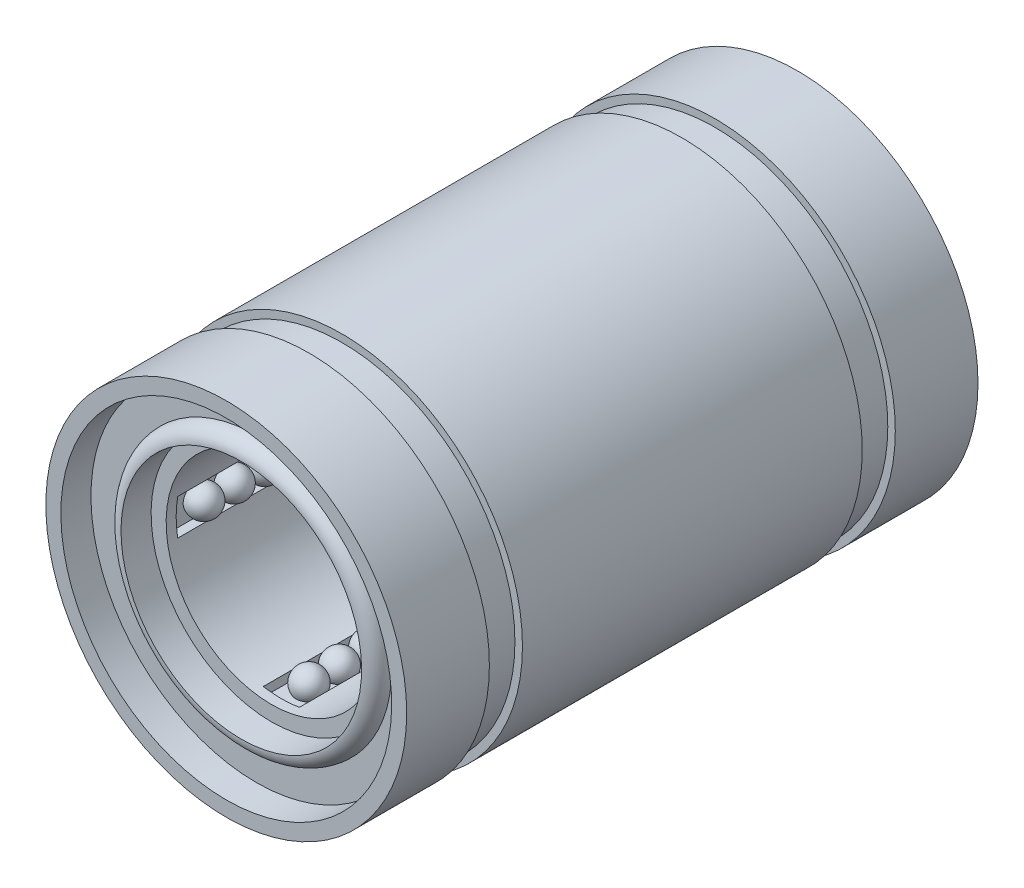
ISO-10303-21;
HEADER;
FILE_DESCRIPTION(('STEP AP214'),'2;1');
FILE_NAME('part.step','',(''),(''),'','','');
FILE_SCHEMA(('AUTOMOTIVE_DESIGN { 1 0 10303 214 1 1 1 1 }'));
ENDSEC;
DATA;
#1=APPLICATION_CONTEXT('core data for automotive mechanical design processes');
#2=APPLICATION_PROTOCOL_DEFINITION('international standard','automotive_design',2000,#1);
#3=PRODUCT_CONTEXT('',#1,'mechanical');
#4=PRODUCT('Part','Part','',(#3));
#5=PRODUCT_RELATED_PRODUCT_CATEGORY('part','',(#4));
#6=PRODUCT_DEFINITION_FORMATION('','',#4);
#7=PRODUCT_DEFINITION_CONTEXT('part definition',#1,'design');
#8=PRODUCT_DEFINITION('design','',#6,#7);
#9=PRODUCT_DEFINITION_SHAPE('','',#8);
#10=(LENGTH_UNIT() NAMED_UNIT(*) SI_UNIT(.MILLI.,.METRE.));
#11=(NAMED_UNIT(*) PLANE_ANGLE_UNIT() SI_UNIT($,.RADIAN.));
#12=(NAMED_UNIT(*) SI_UNIT($,.STERADIAN.) SOLID_ANGLE_UNIT());
#13=UNCERTAINTY_MEASURE_WITH_UNIT(LENGTH_MEASURE(1.E-05),#10,'distance_accuracy_value','');
#14=(GEOMETRIC_REPRESENTATION_CONTEXT(3) GLOBAL_UNCERTAINTY_ASSIGNED_CONTEXT((#13)) GLOBAL_UNIT_ASSIGNED_CONTEXT((#10,
#11,#12)) REPRESENTATION_CONTEXT('',''));
#15=CARTESIAN_POINT('',(0.,0.,0.));
#16=DIRECTION('',(0.,0.,1.));
#17=DIRECTION('',(1.,0.,0.));
#18=AXIS2_PLACEMENT_3D('',#15,#16,#17);
#19=CARTESIAN_POINT('',(0.599999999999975,-3.75000000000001,-17.1666666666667));
#20=DIRECTION('',(0.,1.,0.));
#21=DIRECTION('',(-1.,0.,0.));
#22=AXIS2_PLACEMENT_3D('',#19,#20,#21);
#23=PLANE('',#22);
#24=CARTESIAN_POINT('',(0.,-3.75,-3.75999999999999));
#25=DIRECTION('',(0.,1.,0.));
#26=DIRECTION('',(0.,0.,-1.));
#27=AXIS2_PLACEMENT_3D('',#24,#25,#26);
#28=CIRCLE('',#27,0.43301270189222);
#29=CARTESIAN_POINT('',(0.,-3.75,-4.19301270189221));
#30=VERTEX_POINT('',#29);
#31=EDGE_CURVE('E387',#30,#30,#28,.F.);
#32=ORIENTED_EDGE('',*,*,#31,.T.);
#33=EDGE_LOOP('',(#32));
#34=FACE_BOUND('',#33,.T.);
#35=CARTESIAN_POINT('',(0.,-3.75,-5.77999999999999));
#36=DIRECTION('',(0.,1.,0.));
#37=DIRECTION('',(0.,0.,-1.));
#38=AXIS2_PLACEMENT_3D('',#35,#36,#37);
#39=CIRCLE('',#38,0.43301270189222);
#40=CARTESIAN_POINT('',(0.,-3.75,-6.21301270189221));
#41=VERTEX_POINT('',#40);
#42=EDGE_CURVE('E400',#41,#41,#39,.F.);
#43=ORIENTED_EDGE('',*,*,#42,.T.);
#44=EDGE_LOOP('',(#43));
#45=FACE_BOUND('',#44,.T.);
#46=CARTESIAN_POINT('',(0.,-3.75,-7.8));
#47=DIRECTION('',(0.,1.,0.));
#48=DIRECTION('',(0.,0.,-1.));
#49=AXIS2_PLACEMENT_3D('',#46,#47,#48);
#50=CIRCLE('',#49,0.43301270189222);
#51=CARTESIAN_POINT('',(0.,-3.75,-8.23301270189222));
#52=VERTEX_POINT('',#51);
#53=EDGE_CURVE('E406',#52,#52,#50,.F.);
#54=ORIENTED_EDGE('',*,*,#53,.T.);
#55=EDGE_LOOP('',(#54));
#56=FACE_BOUND('',#55,.T.);
#57=CARTESIAN_POINT('',(0.,-3.75,-9.81999999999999));
#58=DIRECTION('',(0.,1.,0.));
#59=DIRECTION('',(0.,0.,-1.));
#60=AXIS2_PLACEMENT_3D('',#57,#58,#59);
#61=CIRCLE('',#60,0.43301270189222);
#62=CARTESIAN_POINT('',(0.,-3.75,-10.2530127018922));
#63=VERTEX_POINT('',#62);
#64=EDGE_CURVE('E412',#63,#63,#61,.F.);
#65=ORIENTED_EDGE('',*,*,#64,.T.);
#66=EDGE_LOOP('',(#65));
#67=FACE_BOUND('',#66,.T.);
#68=CARTESIAN_POINT('',(0.,-3.75,-11.84));
#69=DIRECTION('',(0.,1.,0.));
#70=DIRECTION('',(0.,0.,-1.));
#71=AXIS2_PLACEMENT_3D('',#68,#69,#70);
#72=CIRCLE('',#71,0.43301270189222);
#73=CARTESIAN_POINT('',(0.,-3.75,-12.2730127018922));
#74=VERTEX_POINT('',#73);
#75=EDGE_CURVE('E418',#74,#74,#72,.F.);
#76=ORIENTED_EDGE('',*,*,#75,.T.);
#77=EDGE_LOOP('',(#76));
#78=FACE_BOUND('',#77,.T.);
#79=CARTESIAN_POINT('',(0.,-3.75,-13.86));
#80=DIRECTION('',(0.,1.,0.));
#81=DIRECTION('',(0.,0.,-1.));
#82=AXIS2_PLACEMENT_3D('',#79,#80,#81);
#83=CIRCLE('',#82,0.43301270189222);
#84=CARTESIAN_POINT('',(0.,-3.75,-14.2930127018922));
#85=VERTEX_POINT('',#84);
#86=EDGE_CURVE('E424',#85,#85,#83,.F.);
#87=ORIENTED_EDGE('',*,*,#86,.T.);
#88=EDGE_LOOP('',(#87));
#89=FACE_BOUND('',#88,.T.);
#90=CARTESIAN_POINT('',(0.,-3.75,-15.88));
#91=DIRECTION('',(0.,1.,0.));
#92=DIRECTION('',(0.,0.,-1.));
#93=AXIS2_PLACEMENT_3D('',#90,#91,#92);
#94=CIRCLE('',#93,0.43301270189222);
#95=CARTESIAN_POINT('',(0.,-3.75,-16.3130127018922));
#96=VERTEX_POINT('',#95);
#97=EDGE_CURVE('E430',#96,#96,#94,.F.);
#98=ORIENTED_EDGE('',*,*,#97,.T.);
#99=EDGE_LOOP('',(#98));
#100=FACE_BOUND('',#99,.T.);
#101=DIRECTION('',(0.,0.,1.));
#102=VECTOR('',#101,1.);
#103=CARTESIAN_POINT('',(0.599999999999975,-3.75000000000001,-17.1666666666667));
#104=LINE('',#103,#102);
#105=CARTESIAN_POINT('',(0.599999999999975,-3.75000000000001,-17.1666666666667));
#106=VERTEX_POINT('',#105);
#107=CARTESIAN_POINT('',(0.599999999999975,-3.75,-1.83333333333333));
#108=VERTEX_POINT('',#107);
#109=EDGE_CURVE('E222',#106,#108,#104,.T.);
#110=ORIENTED_EDGE('',*,*,#109,.F.);
#111=DIRECTION('',(-1.,0.,0.));
#112=VECTOR('',#111,1.);
#113=CARTESIAN_POINT('',(0.599999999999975,-3.75000000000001,-17.1666666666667));
#114=LINE('',#113,#112);
#115=CARTESIAN_POINT('',(-0.600000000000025,-3.75,-17.1666666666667));
#116=VERTEX_POINT('',#115);
#117=EDGE_CURVE('E218',#106,#116,#114,.T.);
#118=ORIENTED_EDGE('',*,*,#117,.T.);
#119=DIRECTION('',(0.,0.,1.));
#120=VECTOR('',#119,1.);
#121=CARTESIAN_POINT('',(-0.600000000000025,-3.75,-17.1666666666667));
#122=LINE('',#121,#120);
#123=CARTESIAN_POINT('',(-0.600000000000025,-3.75,-1.83333333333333));
#124=VERTEX_POINT('',#123);
#125=EDGE_CURVE('E220',#116,#124,#122,.T.);
#126=ORIENTED_EDGE('',*,*,#125,.T.);
#127=DIRECTION('',(-1.,0.,0.));
#128=VECTOR('',#127,1.);
#129=CARTESIAN_POINT('',(0.599999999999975,-3.75,-1.83333333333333));
#130=LINE('',#129,#128);
#131=EDGE_CURVE('E210',#108,#124,#130,.T.);
#132=ORIENTED_EDGE('',*,*,#131,.F.);
#133=EDGE_LOOP('',(#110,#118,#126,#132));
#134=FACE_BOUND('',#133,.T.);
#135=CARTESIAN_POINT('',(0.,-3.75,-14.87));
#136=DIRECTION('',(0.,1.,0.));
#137=DIRECTION('',(0.,0.,-1.));
#138=AXIS2_PLACEMENT_3D('',#135,#136,#137);
#139=CIRCLE('',#138,0.43301270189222);
#140=CARTESIAN_POINT('',(0.,-3.75,-15.3030127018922));
#141=VERTEX_POINT('',#140);
#142=EDGE_CURVE('E427',#141,#141,#139,.F.);
#143=ORIENTED_EDGE('',*,*,#142,.T.);
#144=EDGE_LOOP('',(#143));
#145=FACE_BOUND('',#144,.T.);
#146=CARTESIAN_POINT('',(0.,-3.75,-12.85));
#147=DIRECTION('',(0.,1.,0.));
#148=DIRECTION('',(0.,0.,-1.));
#149=AXIS2_PLACEMENT_3D('',#146,#147,#148);
#150=CIRCLE('',#149,0.43301270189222);
#151=CARTESIAN_POINT('',(0.,-3.75,-13.2830127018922));
#152=VERTEX_POINT('',#151);
#153=EDGE_CURVE('E421',#152,#152,#150,.F.);
#154=ORIENTED_EDGE('',*,*,#153,.T.);
#155=EDGE_LOOP('',(#154));
#156=FACE_BOUND('',#155,.T.);
#157=CARTESIAN_POINT('',(0.,-3.75,-10.83));
#158=DIRECTION('',(0.,1.,0.));
#159=DIRECTION('',(0.,0.,-1.));
#160=AXIS2_PLACEMENT_3D('',#157,#158,#159);
#161=CIRCLE('',#160,0.43301270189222);
#162=CARTESIAN_POINT('',(0.,-3.75,-11.2630127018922));
#163=VERTEX_POINT('',#162);
#164=EDGE_CURVE('E415',#163,#163,#161,.F.);
#165=ORIENTED_EDGE('',*,*,#164,.T.);
#166=EDGE_LOOP('',(#165));
#167=FACE_BOUND('',#166,.T.);
#168=CARTESIAN_POINT('',(0.,-3.75,-8.81));
#169=DIRECTION('',(0.,1.,0.));
#170=DIRECTION('',(0.,0.,-1.));
#171=AXIS2_PLACEMENT_3D('',#168,#169,#170);
#172=CIRCLE('',#171,0.43301270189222);
#173=CARTESIAN_POINT('',(0.,-3.75,-9.24301270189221));
#174=VERTEX_POINT('',#173);
#175=EDGE_CURVE('E409',#174,#174,#172,.F.);
#176=ORIENTED_EDGE('',*,*,#175,.T.);
#177=EDGE_LOOP('',(#176));
#178=FACE_BOUND('',#177,.T.);
#179=CARTESIAN_POINT('',(0.,-3.75,-6.78999999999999));
#180=DIRECTION('',(0.,1.,0.));
#181=DIRECTION('',(0.,0.,-1.));
#182=AXIS2_PLACEMENT_3D('',#179,#180,#181);
#183=CIRCLE('',#182,0.43301270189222);
#184=CARTESIAN_POINT('',(0.,-3.75,-7.22301270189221));
#185=VERTEX_POINT('',#184);
#186=EDGE_CURVE('E403',#185,#185,#183,.F.);
#187=ORIENTED_EDGE('',*,*,#186,.T.);
#188=EDGE_LOOP('',(#187));
#189=FACE_BOUND('',#188,.T.);
#190=CARTESIAN_POINT('',(0.,-3.75,-4.77));
#191=DIRECTION('',(0.,1.,0.));
#192=DIRECTION('',(0.,0.,-1.));
#193=AXIS2_PLACEMENT_3D('',#190,#191,#192);
#194=CIRCLE('',#193,0.43301270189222);
#195=CARTESIAN_POINT('',(0.,-3.75,-5.20301270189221));
#196=VERTEX_POINT('',#195);
#197=EDGE_CURVE('E392',#196,#196,#194,.F.);
#198=ORIENTED_EDGE('',*,*,#197,.T.);
#199=EDGE_LOOP('',(#198));
#200=FACE_BOUND('',#199,.T.);
#201=CARTESIAN_POINT('',(0.,-3.75,-2.74999999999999));
#202=DIRECTION('',(0.,1.,0.));
#203=DIRECTION('',(0.,0.,-1.));
#204=AXIS2_PLACEMENT_3D('',#201,#202,#203);
#205=CIRCLE('',#204,0.43301270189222);
#206=CARTESIAN_POINT('',(0.,-3.75,-3.18301270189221));
#207=VERTEX_POINT('',#206);
#208=EDGE_CURVE('E383',#207,#207,#205,.F.);
#209=ORIENTED_EDGE('',*,*,#208,.T.);
#210=EDGE_LOOP('',(#209));
#211=FACE_BOUND('',#210,.T.);
#212=ADVANCED_FACE('F42',(#34,#45,#56,#67,#78,#89,#100,#134,#145,#156,#167,#178,#189,#200,#211),
#23,.T.);
#213=CARTESIAN_POINT('',(-3.75000000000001,-0.599999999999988,-17.1666666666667));
#214=DIRECTION('',(1.,0.,0.));
#215=DIRECTION('',(0.,0.,1.));
#216=AXIS2_PLACEMENT_3D('',#213,#214,#215);
#217=PLANE('',#216);
#218=CARTESIAN_POINT('',(-3.75,0.,-14.87));
#219=DIRECTION('',(1.,0.,0.));
#220=DIRECTION('',(0.,0.,-1.));
#221=AXIS2_PLACEMENT_3D('',#218,#219,#220);
#222=CIRCLE('',#221,0.43301270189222);
#223=CARTESIAN_POINT('',(-3.75,0.,-15.3030127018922));
#224=VERTEX_POINT('',#223);
#225=EDGE_CURVE('E475',#224,#224,#222,.F.);
#226=ORIENTED_EDGE('',*,*,#225,.T.);
#227=EDGE_LOOP('',(#226));
#228=FACE_BOUND('',#227,.T.);
#229=CARTESIAN_POINT('',(-3.75,0.,-12.85));
#230=DIRECTION('',(1.,0.,0.));
#231=DIRECTION('',(0.,0.,-1.));
#232=AXIS2_PLACEMENT_3D('',#229,#230,#231);
#233=CIRCLE('',#232,0.43301270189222);
#234=CARTESIAN_POINT('',(-3.75,0.,-13.2830127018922));
#235=VERTEX_POINT('',#234);
#236=EDGE_CURVE('E470',#235,#235,#233,.F.);
#237=ORIENTED_EDGE('',*,*,#236,.T.);
#238=EDGE_LOOP('',(#237));
#239=FACE_BOUND('',#238,.T.);
#240=CARTESIAN_POINT('',(-3.75,0.,-10.83));
#241=DIRECTION('',(1.,0.,0.));
#242=DIRECTION('',(0.,0.,-1.));
#243=AXIS2_PLACEMENT_3D('',#240,#241,#242);
#244=CIRCLE('',#243,0.43301270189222);
#245=CARTESIAN_POINT('',(-3.75,0.,-11.2630127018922));
#246=VERTEX_POINT('',#245);
#247=EDGE_CURVE('E464',#246,#246,#244,.F.);
#248=ORIENTED_EDGE('',*,*,#247,.T.);
#249=EDGE_LOOP('',(#248));
#250=FACE_BOUND('',#249,.T.);
#251=CARTESIAN_POINT('',(-3.75,0.,-8.81));
#252=DIRECTION('',(1.,0.,0.));
#253=DIRECTION('',(0.,0.,-1.));
#254=AXIS2_PLACEMENT_3D('',#251,#252,#253);
#255=CIRCLE('',#254,0.43301270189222);
#256=CARTESIAN_POINT('',(-3.75,0.,-9.24301270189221));
#257=VERTEX_POINT('',#256);
#258=EDGE_CURVE('E458',#257,#257,#255,.F.);
#259=ORIENTED_EDGE('',*,*,#258,.T.);
#260=EDGE_LOOP('',(#259));
#261=FACE_BOUND('',#260,.T.);
#262=CARTESIAN_POINT('',(-3.75,0.,-6.78999999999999));
#263=DIRECTION('',(1.,0.,0.));
#264=DIRECTION('',(0.,0.,-1.));
#265=AXIS2_PLACEMENT_3D('',#262,#263,#264);
#266=CIRCLE('',#265,0.43301270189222);
#267=CARTESIAN_POINT('',(-3.75,0.,-7.22301270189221));
#268=VERTEX_POINT('',#267);
#269=EDGE_CURVE('E452',#268,#268,#266,.F.);
#270=ORIENTED_EDGE('',*,*,#269,.T.);
#271=EDGE_LOOP('',(#270));
#272=FACE_BOUND('',#271,.T.);
#273=CARTESIAN_POINT('',(-3.75,0.,-4.77));
#274=DIRECTION('',(1.,0.,0.));
#275=DIRECTION('',(0.,0.,-1.));
#276=AXIS2_PLACEMENT_3D('',#273,#274,#275);
#277=CIRCLE('',#276,0.43301270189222);
#278=CARTESIAN_POINT('',(-3.75,0.,-5.20301270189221));
#279=VERTEX_POINT('',#278);
#280=EDGE_CURVE('E441',#279,#279,#277,.F.);
#281=ORIENTED_EDGE('',*,*,#280,.T.);
#282=EDGE_LOOP('',(#281));
#283=FACE_BOUND('',#282,.T.);
#284=CARTESIAN_POINT('',(-3.75,0.,-2.74999999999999));
#285=DIRECTION('',(1.,0.,0.));
#286=DIRECTION('',(0.,0.,-1.));
#287=AXIS2_PLACEMENT_3D('',#284,#285,#286);
#288=CIRCLE('',#287,0.43301270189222);
#289=CARTESIAN_POINT('',(-3.75,0.,-3.18301270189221));
#290=VERTEX_POINT('',#289);
#291=EDGE_CURVE('E432',#290,#290,#288,.F.);
#292=ORIENTED_EDGE('',*,*,#291,.T.);
#293=EDGE_LOOP('',(#292));
#294=FACE_BOUND('',#293,.T.);
#295=DIRECTION('',(0.,0.,1.));
#296=VECTOR('',#295,1.);
#297=CARTESIAN_POINT('',(-3.75000000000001,-0.599999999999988,-17.1666666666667));
#298=LINE('',#297,#296);
#299=CARTESIAN_POINT('',(-3.75000000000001,-0.599999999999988,-17.1666666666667));
#300=VERTEX_POINT('',#299);
#301=CARTESIAN_POINT('',(-3.75,-0.599999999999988,-1.83333333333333));
#302=VERTEX_POINT('',#301);
#303=EDGE_CURVE('E203',#300,#302,#298,.T.);
#304=ORIENTED_EDGE('',*,*,#303,.F.);
#305=DIRECTION('',(0.,1.,0.));
#306=VECTOR('',#305,1.);
#307=CARTESIAN_POINT('',(-3.75000000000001,-0.599999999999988,-17.1666666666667));
#308=LINE('',#307,#306);
#309=CARTESIAN_POINT('',(-3.75,0.600000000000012,-17.1666666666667));
#310=VERTEX_POINT('',#309);
#311=EDGE_CURVE('E199',#300,#310,#308,.T.);
#312=ORIENTED_EDGE('',*,*,#311,.T.);
#313=DIRECTION('',(0.,0.,1.));
#314=VECTOR('',#313,1.);
#315=CARTESIAN_POINT('',(-3.75,0.600000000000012,-17.1666666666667));
#316=LINE('',#315,#314);
#317=CARTESIAN_POINT('',(-3.75,0.600000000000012,-1.83333333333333));
#318=VERTEX_POINT('',#317);
#319=EDGE_CURVE('E201',#310,#318,#316,.T.);
#320=ORIENTED_EDGE('',*,*,#319,.T.);
#321=DIRECTION('',(0.,1.,0.));
#322=VECTOR('',#321,1.);
#323=CARTESIAN_POINT('',(-3.75,-0.599999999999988,-1.83333333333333));
#324=LINE('',#323,#322);
#325=EDGE_CURVE('E192',#302,#318,#324,.T.);
#326=ORIENTED_EDGE('',*,*,#325,.F.);
#327=EDGE_LOOP('',(#304,#312,#320,#326));
#328=FACE_BOUND('',#327,.T.);
#329=CARTESIAN_POINT('',(-3.75,0.,-3.75999999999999));
#330=DIRECTION('',(1.,0.,0.));
#331=DIRECTION('',(0.,0.,-1.));
#332=AXIS2_PLACEMENT_3D('',#329,#330,#331);
#333=CIRCLE('',#332,0.43301270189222);
#334=CARTESIAN_POINT('',(-3.75,0.,-4.19301270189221));
#335=VERTEX_POINT('',#334);
#336=EDGE_CURVE('E436',#335,#335,#333,.F.);
#337=ORIENTED_EDGE('',*,*,#336,.T.);
#338=EDGE_LOOP('',(#337));
#339=FACE_BOUND('',#338,.T.);
#340=CARTESIAN_POINT('',(-3.75,0.,-5.77999999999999));
#341=DIRECTION('',(1.,0.,0.));
#342=DIRECTION('',(0.,0.,-1.));
#343=AXIS2_PLACEMENT_3D('',#340,#341,#342);
#344=CIRCLE('',#343,0.43301270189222);
#345=CARTESIAN_POINT('',(-3.75,0.,-6.21301270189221));
#346=VERTEX_POINT('',#345);
#347=EDGE_CURVE('E449',#346,#346,#344,.F.);
#348=ORIENTED_EDGE('',*,*,#347,.T.);
#349=EDGE_LOOP('',(#348));
#350=FACE_BOUND('',#349,.T.);
#351=CARTESIAN_POINT('',(-3.75,0.,-7.8));
#352=DIRECTION('',(1.,0.,0.));
#353=DIRECTION('',(0.,0.,-1.));
#354=AXIS2_PLACEMENT_3D('',#351,#352,#353);
#355=CIRCLE('',#354,0.43301270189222);
#356=CARTESIAN_POINT('',(-3.75,0.,-8.23301270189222));
#357=VERTEX_POINT('',#356);
#358=EDGE_CURVE('E455',#357,#357,#355,.F.);
#359=ORIENTED_EDGE('',*,*,#358,.T.);
#360=EDGE_LOOP('',(#359));
#361=FACE_BOUND('',#360,.T.);
#362=CARTESIAN_POINT('',(-3.75,0.,-9.81999999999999));
#363=DIRECTION('',(1.,0.,0.));
#364=DIRECTION('',(0.,0.,-1.));
#365=AXIS2_PLACEMENT_3D('',#362,#363,#364);
#366=CIRCLE('',#365,0.43301270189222);
#367=CARTESIAN_POINT('',(-3.75,0.,-10.2530127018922));
#368=VERTEX_POINT('',#367);
#369=EDGE_CURVE('E461',#368,#368,#366,.F.);
#370=ORIENTED_EDGE('',*,*,#369,.T.);
#371=EDGE_LOOP('',(#370));
#372=FACE_BOUND('',#371,.T.);
#373=CARTESIAN_POINT('',(-3.75,0.,-11.84));
#374=DIRECTION('',(1.,0.,0.));
#375=DIRECTION('',(0.,0.,-1.));
#376=AXIS2_PLACEMENT_3D('',#373,#374,#375);
#377=CIRCLE('',#376,0.43301270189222);
#378=CARTESIAN_POINT('',(-3.75,0.,-12.2730127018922));
#379=VERTEX_POINT('',#378);
#380=EDGE_CURVE('E467',#379,#379,#377,.F.);
#381=ORIENTED_EDGE('',*,*,#380,.T.);
#382=EDGE_LOOP('',(#381));
#383=FACE_BOUND('',#382,.T.);
#384=CARTESIAN_POINT('',(-3.75,0.,-13.86));
#385=DIRECTION('',(1.,0.,0.));
#386=DIRECTION('',(0.,0.,-1.));
#387=AXIS2_PLACEMENT_3D('',#384,#385,#386);
#388=CIRCLE('',#387,0.43301270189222);
#389=CARTESIAN_POINT('',(-3.75,0.,-14.2930127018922));
#390=VERTEX_POINT('',#389);
#391=EDGE_CURVE('E473',#390,#390,#388,.F.);
#392=ORIENTED_EDGE('',*,*,#391,.T.);
#393=EDGE_LOOP('',(#392));
#394=FACE_BOUND('',#393,.T.);
#395=CARTESIAN_POINT('',(-3.75,0.,-15.88));
#396=DIRECTION('',(1.,0.,0.));
#397=DIRECTION('',(0.,0.,-1.));
#398=AXIS2_PLACEMENT_3D('',#395,#396,#397);
#399=CIRCLE('',#398,0.43301270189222);
#400=CARTESIAN_POINT('',(-3.75,0.,-16.3130127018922));
#401=VERTEX_POINT('',#400);
#402=EDGE_CURVE('E395',#401,#401,#399,.F.);
#403=ORIENTED_EDGE('',*,*,#402,.T.);
#404=EDGE_LOOP('',(#403));
#405=FACE_BOUND('',#404,.T.);
#406=ADVANCED_FACE('F543',(#228,#239,#250,#261,#272,#283,#294,#328,#339,#350,#361,#372,#383,
#394,#405),#217,.T.);
#407=CARTESIAN_POINT('',(-0.599999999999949,3.75000000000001,-17.1666666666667));
#408=DIRECTION('',(0.,-1.,0.));
#409=DIRECTION('',(1.,0.,0.));
#410=AXIS2_PLACEMENT_3D('',#407,#408,#409);
#411=PLANE('',#410);
#412=CARTESIAN_POINT('',(0.,3.75,-3.75999999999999));
#413=DIRECTION('',(0.,-1.,0.));
#414=DIRECTION('',(0.,0.,-1.));
#415=AXIS2_PLACEMENT_3D('',#412,#413,#414);
#416=CIRCLE('',#415,0.43301270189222);
#417=CARTESIAN_POINT('',(0.,3.75,-4.19301270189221));
#418=VERTEX_POINT('',#417);
#419=EDGE_CURVE('E484',#418,#418,#416,.F.);
#420=ORIENTED_EDGE('',*,*,#419,.T.);
#421=EDGE_LOOP('',(#420));
#422=FACE_BOUND('',#421,.T.);
#423=CARTESIAN_POINT('',(0.,3.75,-5.77999999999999));
#424=DIRECTION('',(0.,-1.,0.));
#425=DIRECTION('',(0.,0.,-1.));
#426=AXIS2_PLACEMENT_3D('',#423,#424,#425);
#427=CIRCLE('',#426,0.43301270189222);
#428=CARTESIAN_POINT('',(0.,3.75,-6.21301270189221));
#429=VERTEX_POINT('',#428);
#430=EDGE_CURVE('E494',#429,#429,#427,.F.);
#431=ORIENTED_EDGE('',*,*,#430,.T.);
#432=EDGE_LOOP('',(#431));
#433=FACE_BOUND('',#432,.T.);
#434=CARTESIAN_POINT('',(0.,3.75,-7.8));
#435=DIRECTION('',(0.,-1.,0.));
#436=DIRECTION('',(0.,0.,-1.));
#437=AXIS2_PLACEMENT_3D('',#434,#435,#436);
#438=CIRCLE('',#437,0.43301270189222);
#439=CARTESIAN_POINT('',(0.,3.75,-8.23301270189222));
#440=VERTEX_POINT('',#439);
#441=EDGE_CURVE('E500',#440,#440,#438,.F.);
#442=ORIENTED_EDGE('',*,*,#441,.T.);
#443=EDGE_LOOP('',(#442));
#444=FACE_BOUND('',#443,.T.);
#445=CARTESIAN_POINT('',(0.,3.75,-9.81999999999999));
#446=DIRECTION('',(0.,-1.,0.));
#447=DIRECTION('',(0.,0.,-1.));
#448=AXIS2_PLACEMENT_3D('',#445,#446,#447);
#449=CIRCLE('',#448,0.43301270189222);
#450=CARTESIAN_POINT('',(0.,3.75,-10.2530127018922));
#451=VERTEX_POINT('',#450);
#452=EDGE_CURVE('E506',#451,#451,#449,.F.);
#453=ORIENTED_EDGE('',*,*,#452,.T.);
#454=EDGE_LOOP('',(#453));
#455=FACE_BOUND('',#454,.T.);
#456=CARTESIAN_POINT('',(0.,3.75,-11.84));
#457=DIRECTION('',(0.,-1.,0.));
#458=DIRECTION('',(0.,0.,-1.));
#459=AXIS2_PLACEMENT_3D('',#456,#457,#458);
#460=CIRCLE('',#459,0.43301270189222);
#461=CARTESIAN_POINT('',(0.,3.75,-12.2730127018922));
#462=VERTEX_POINT('',#461);
#463=EDGE_CURVE('E512',#462,#462,#460,.F.);
#464=ORIENTED_EDGE('',*,*,#463,.T.);
#465=EDGE_LOOP('',(#464));
#466=FACE_BOUND('',#465,.T.);
#467=CARTESIAN_POINT('',(0.,3.75,-13.86));
#468=DIRECTION('',(0.,-1.,0.));
#469=DIRECTION('',(0.,0.,-1.));
#470=AXIS2_PLACEMENT_3D('',#467,#468,#469);
#471=CIRCLE('',#470,0.43301270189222);
#472=CARTESIAN_POINT('',(0.,3.75,-14.2930127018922));
#473=VERTEX_POINT('',#472);
#474=EDGE_CURVE('E518',#473,#473,#471,.F.);
#475=ORIENTED_EDGE('',*,*,#474,.T.);
#476=EDGE_LOOP('',(#475));
#477=FACE_BOUND('',#476,.T.);
#478=CARTESIAN_POINT('',(0.,3.75,-15.88));
#479=DIRECTION('',(0.,-1.,0.));
#480=DIRECTION('',(0.,0.,-1.));
#481=AXIS2_PLACEMENT_3D('',#478,#479,#480);
#482=CIRCLE('',#481,0.43301270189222);
#483=CARTESIAN_POINT('',(0.,3.75,-16.3130127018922));
#484=VERTEX_POINT('',#483);
#485=EDGE_CURVE('E444',#484,#484,#482,.F.);
#486=ORIENTED_EDGE('',*,*,#485,.T.);
#487=EDGE_LOOP('',(#486));
#488=FACE_BOUND('',#487,.T.);
#489=DIRECTION('',(0.,0.,1.));
#490=VECTOR('',#489,1.);
#491=CARTESIAN_POINT('',(-0.599999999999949,3.75000000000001,-17.1666666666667));
#492=LINE('',#491,#490);
#493=CARTESIAN_POINT('',(-0.599999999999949,3.75000000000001,-17.1666666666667));
#494=VERTEX_POINT('',#493);
#495=CARTESIAN_POINT('',(-0.599999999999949,3.75000000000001,-1.83333333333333));
#496=VERTEX_POINT('',#495);
#497=EDGE_CURVE('E168',#494,#496,#492,.T.);
#498=ORIENTED_EDGE('',*,*,#497,.F.);
#499=DIRECTION('',(1.,0.,0.));
#500=VECTOR('',#499,1.);
#501=CARTESIAN_POINT('',(-0.599999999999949,3.75000000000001,-17.1666666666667));
#502=LINE('',#501,#500);
#503=CARTESIAN_POINT('',(0.600000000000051,3.75,-17.1666666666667));
#504=VERTEX_POINT('',#503);
#505=EDGE_CURVE('E186',#494,#504,#502,.T.);
#506=ORIENTED_EDGE('',*,*,#505,.T.);
#507=DIRECTION('',(0.,0.,1.));
#508=VECTOR('',#507,1.);
#509=CARTESIAN_POINT('',(0.600000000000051,3.75,-17.1666666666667));
#510=LINE('',#509,#508);
#511=CARTESIAN_POINT('',(0.600000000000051,3.74999999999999,-1.83333333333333));
#512=VERTEX_POINT('',#511);
#513=EDGE_CURVE('E174',#504,#512,#510,.T.);
#514=ORIENTED_EDGE('',*,*,#513,.T.);
#515=DIRECTION('',(1.,0.,0.));
#516=VECTOR('',#515,1.);
#517=CARTESIAN_POINT('',(-0.599999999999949,3.75000000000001,-1.83333333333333));
#518=LINE('',#517,#516);
#519=EDGE_CURVE('E161',#496,#512,#518,.T.);
#520=ORIENTED_EDGE('',*,*,#519,.F.);
#521=EDGE_LOOP('',(#498,#506,#514,#520));
#522=FACE_BOUND('',#521,.T.);
#523=CARTESIAN_POINT('',(0.,3.75,-14.87));
#524=DIRECTION('',(0.,-1.,0.));
#525=DIRECTION('',(0.,0.,-1.));
#526=AXIS2_PLACEMENT_3D('',#523,#524,#525);
#527=CIRCLE('',#526,0.43301270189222);
#528=CARTESIAN_POINT('',(0.,3.75,-15.3030127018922));
#529=VERTEX_POINT('',#528);
#530=EDGE_CURVE('E520',#529,#529,#527,.F.);
#531=ORIENTED_EDGE('',*,*,#530,.T.);
#532=EDGE_LOOP('',(#531));
#533=FACE_BOUND('',#532,.T.);
#534=CARTESIAN_POINT('',(0.,3.75,-12.85));
#535=DIRECTION('',(0.,-1.,0.));
#536=DIRECTION('',(0.,0.,-1.));
#537=AXIS2_PLACEMENT_3D('',#534,#535,#536);
#538=CIRCLE('',#537,0.43301270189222);
#539=CARTESIAN_POINT('',(0.,3.75,-13.2830127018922));
#540=VERTEX_POINT('',#539);
#541=EDGE_CURVE('E515',#540,#540,#538,.F.);
#542=ORIENTED_EDGE('',*,*,#541,.T.);
#543=EDGE_LOOP('',(#542));
#544=FACE_BOUND('',#543,.T.);
#545=CARTESIAN_POINT('',(0.,3.75,-10.83));
#546=DIRECTION('',(0.,-1.,0.));
#547=DIRECTION('',(0.,0.,-1.));
#548=AXIS2_PLACEMENT_3D('',#545,#546,#547);
#549=CIRCLE('',#548,0.43301270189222);
#550=CARTESIAN_POINT('',(0.,3.75,-11.2630127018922));
#551=VERTEX_POINT('',#550);
#552=EDGE_CURVE('E509',#551,#551,#549,.F.);
#553=ORIENTED_EDGE('',*,*,#552,.T.);
#554=EDGE_LOOP('',(#553));
#555=FACE_BOUND('',#554,.T.);
#556=CARTESIAN_POINT('',(0.,3.75,-8.81));
#557=DIRECTION('',(0.,-1.,0.));
#558=DIRECTION('',(0.,0.,-1.));
#559=AXIS2_PLACEMENT_3D('',#556,#557,#558);
#560=CIRCLE('',#559,0.43301270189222);
#561=CARTESIAN_POINT('',(0.,3.75,-9.24301270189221));
#562=VERTEX_POINT('',#561);
#563=EDGE_CURVE('E503',#562,#562,#560,.F.);
#564=ORIENTED_EDGE('',*,*,#563,.T.);
#565=EDGE_LOOP('',(#564));
#566=FACE_BOUND('',#565,.T.);
#567=CARTESIAN_POINT('',(0.,3.75,-6.78999999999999));
#568=DIRECTION('',(0.,-1.,0.));
#569=DIRECTION('',(0.,0.,-1.));
#570=AXIS2_PLACEMENT_3D('',#567,#568,#569);
#571=CIRCLE('',#570,0.43301270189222);
#572=CARTESIAN_POINT('',(0.,3.75,-7.22301270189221));
#573=VERTEX_POINT('',#572);
#574=EDGE_CURVE('E497',#573,#573,#571,.F.);
#575=ORIENTED_EDGE('',*,*,#574,.T.);
#576=EDGE_LOOP('',(#575));
#577=FACE_BOUND('',#576,.T.);
#578=CARTESIAN_POINT('',(0.,3.75,-4.77));
#579=DIRECTION('',(0.,-1.,0.));
#580=DIRECTION('',(0.,0.,-1.));
#581=AXIS2_PLACEMENT_3D('',#578,#579,#580);
#582=CIRCLE('',#581,0.43301270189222);
#583=CARTESIAN_POINT('',(0.,3.75,-5.20301270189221));
#584=VERTEX_POINT('',#583);
#585=EDGE_CURVE('E489',#584,#584,#582,.F.);
#586=ORIENTED_EDGE('',*,*,#585,.T.);
#587=EDGE_LOOP('',(#586));
#588=FACE_BOUND('',#587,.T.);
#589=CARTESIAN_POINT('',(0.,3.75,-2.74999999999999));
#590=DIRECTION('',(0.,-1.,0.));
#591=DIRECTION('',(0.,0.,-1.));
#592=AXIS2_PLACEMENT_3D('',#589,#590,#591);
#593=CIRCLE('',#592,0.43301270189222);
#594=CARTESIAN_POINT('',(0.,3.75,-3.18301270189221));
#595=VERTEX_POINT('',#594);
#596=EDGE_CURVE('E480',#595,#595,#593,.F.);
#597=ORIENTED_EDGE('',*,*,#596,.T.);
#598=EDGE_LOOP('',(#597));
#599=FACE_BOUND('',#598,.T.);
#600=ADVANCED_FACE('F176',(#422,#433,#444,#455,#466,#477,#488,#522,#533,#544,#555,#566,#577,
#588,#599),#411,.T.);
#601=CARTESIAN_POINT('',(3.75000000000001,0.599999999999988,-17.1666666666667));
#602=DIRECTION('',(-1.,0.,0.));
#603=DIRECTION('',(0.,0.,-1.));
#604=AXIS2_PLACEMENT_3D('',#601,#602,#603);
#605=PLANE('',#604);
#606=CARTESIAN_POINT('',(3.75,0.,-14.87));
#607=DIRECTION('',(-1.,0.,0.));
#608=DIRECTION('',(0.,0.,-1.));
#609=AXIS2_PLACEMENT_3D('',#606,#607,#608);
#610=CIRCLE('',#609,0.43301270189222);
#611=CARTESIAN_POINT('',(3.75,0.,-15.3030127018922));
#612=VERTEX_POINT('',#611);
#613=EDGE_CURVE('E378',#612,#612,#610,.F.);
#614=ORIENTED_EDGE('',*,*,#613,.T.);
#615=EDGE_LOOP('',(#614));
#616=FACE_BOUND('',#615,.T.);
#617=CARTESIAN_POINT('',(3.75,0.,-12.85));
#618=DIRECTION('',(-1.,0.,0.));
#619=DIRECTION('',(0.,0.,-1.));
#620=AXIS2_PLACEMENT_3D('',#617,#618,#619);
#621=CIRCLE('',#620,0.43301270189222);
#622=CARTESIAN_POINT('',(3.75,0.,-13.2830127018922));
#623=VERTEX_POINT('',#622);
#624=EDGE_CURVE('E373',#623,#623,#621,.F.);
#625=ORIENTED_EDGE('',*,*,#624,.T.);
#626=EDGE_LOOP('',(#625));
#627=FACE_BOUND('',#626,.T.);
#628=CARTESIAN_POINT('',(3.75,0.,-10.83));
#629=DIRECTION('',(-1.,0.,0.));
#630=DIRECTION('',(0.,0.,-1.));
#631=AXIS2_PLACEMENT_3D('',#628,#629,#630);
#632=CIRCLE('',#631,0.43301270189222);
#633=CARTESIAN_POINT('',(3.75,0.,-11.2630127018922));
#634=VERTEX_POINT('',#633);
#635=EDGE_CURVE('E367',#634,#634,#632,.F.);
#636=ORIENTED_EDGE('',*,*,#635,.T.);
#637=EDGE_LOOP('',(#636));
#638=FACE_BOUND('',#637,.T.);
#639=CARTESIAN_POINT('',(3.75,0.,-8.81));
#640=DIRECTION('',(-1.,0.,0.));
#641=DIRECTION('',(0.,0.,-1.));
#642=AXIS2_PLACEMENT_3D('',#639,#640,#641);
#643=CIRCLE('',#642,0.43301270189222);
#644=CARTESIAN_POINT('',(3.75,0.,-9.24301270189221));
#645=VERTEX_POINT('',#644);
#646=EDGE_CURVE('E361',#645,#645,#643,.F.);
#647=ORIENTED_EDGE('',*,*,#646,.T.);
#648=EDGE_LOOP('',(#647));
#649=FACE_BOUND('',#648,.T.);
#650=CARTESIAN_POINT('',(3.75,0.,-6.78999999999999));
#651=DIRECTION('',(-1.,0.,0.));
#652=DIRECTION('',(0.,0.,-1.));
#653=AXIS2_PLACEMENT_3D('',#650,#651,#652);
#654=CIRCLE('',#653,0.43301270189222);
#655=CARTESIAN_POINT('',(3.75,0.,-7.22301270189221));
#656=VERTEX_POINT('',#655);
#657=EDGE_CURVE('E355',#656,#656,#654,.F.);
#658=ORIENTED_EDGE('',*,*,#657,.T.);
#659=EDGE_LOOP('',(#658));
#660=FACE_BOUND('',#659,.T.);
#661=CARTESIAN_POINT('',(3.75,0.,-4.77));
#662=DIRECTION('',(-1.,0.,0.));
#663=DIRECTION('',(0.,0.,-1.));
#664=AXIS2_PLACEMENT_3D('',#661,#662,#663);
#665=CIRCLE('',#664,0.43301270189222);
#666=CARTESIAN_POINT('',(3.75,0.,-5.20301270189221));
#667=VERTEX_POINT('',#666);
#668=EDGE_CURVE('E349',#667,#667,#665,.F.);
#669=ORIENTED_EDGE('',*,*,#668,.T.);
#670=EDGE_LOOP('',(#669));
#671=FACE_BOUND('',#670,.T.);
#672=CARTESIAN_POINT('',(3.75,0.,-2.74999999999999));
#673=DIRECTION('',(-1.,0.,0.));
#674=DIRECTION('',(0.,0.,-1.));
#675=AXIS2_PLACEMENT_3D('',#672,#673,#674);
#676=CIRCLE('',#675,0.43301270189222);
#677=CARTESIAN_POINT('',(3.75,0.,-3.18301270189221));
#678=VERTEX_POINT('',#677);
#679=EDGE_CURVE('E343',#678,#678,#676,.F.);
#680=ORIENTED_EDGE('',*,*,#679,.T.);
#681=EDGE_LOOP('',(#680));
#682=FACE_BOUND('',#681,.T.);
#683=DIRECTION('',(0.,0.,1.));
#684=VECTOR('',#683,1.);
#685=CARTESIAN_POINT('',(3.75000000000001,0.599999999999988,-17.1666666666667));
#686=LINE('',#685,#684);
#687=CARTESIAN_POINT('',(3.75000000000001,0.599999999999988,-17.1666666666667));
#688=VERTEX_POINT('',#687);
#689=CARTESIAN_POINT('',(3.75,0.599999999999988,-1.83333333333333));
#690=VERTEX_POINT('',#689);
#691=EDGE_CURVE('E241',#688,#690,#686,.T.);
#692=ORIENTED_EDGE('',*,*,#691,.F.);
#693=DIRECTION('',(0.,-1.,0.));
#694=VECTOR('',#693,1.);
#695=CARTESIAN_POINT('',(3.75000000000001,0.599999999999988,-17.1666666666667));
#696=LINE('',#695,#694);
#697=CARTESIAN_POINT('',(3.75,-0.600000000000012,-17.1666666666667));
#698=VERTEX_POINT('',#697);
#699=EDGE_CURVE('E237',#688,#698,#696,.T.);
#700=ORIENTED_EDGE('',*,*,#699,.T.);
#701=DIRECTION('',(0.,0.,1.));
#702=VECTOR('',#701,1.);
#703=CARTESIAN_POINT('',(3.75,-0.600000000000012,-17.1666666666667));
#704=LINE('',#703,#702);
#705=CARTESIAN_POINT('',(3.75,-0.600000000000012,-1.83333333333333));
#706=VERTEX_POINT('',#705);
#707=EDGE_CURVE('E239',#698,#706,#704,.T.);
#708=ORIENTED_EDGE('',*,*,#707,.T.);
#709=DIRECTION('',(0.,-1.,0.));
#710=VECTOR('',#709,1.);
#711=CARTESIAN_POINT('',(3.75,0.599999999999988,-1.83333333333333));
#712=LINE('',#711,#710);
#713=EDGE_CURVE('E229',#690,#706,#712,.T.);
#714=ORIENTED_EDGE('',*,*,#713,.F.);
#715=EDGE_LOOP('',(#692,#700,#708,#714));
#716=FACE_BOUND('',#715,.T.);
#717=CARTESIAN_POINT('',(3.75,0.,-3.75999999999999));
#718=DIRECTION('',(-1.,0.,0.));
#719=DIRECTION('',(0.,0.,-1.));
#720=AXIS2_PLACEMENT_3D('',#717,#718,#719);
#721=CIRCLE('',#720,0.43301270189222);
#722=CARTESIAN_POINT('',(3.75,0.,-4.19301270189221));
#723=VERTEX_POINT('',#722);
#724=EDGE_CURVE('E346',#723,#723,#721,.F.);
#725=ORIENTED_EDGE('',*,*,#724,.T.);
#726=EDGE_LOOP('',(#725));
#727=FACE_BOUND('',#726,.T.);
#728=CARTESIAN_POINT('',(3.75,0.,-5.77999999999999));
#729=DIRECTION('',(-1.,0.,0.));
#730=DIRECTION('',(0.,0.,-1.));
#731=AXIS2_PLACEMENT_3D('',#728,#729,#730);
#732=CIRCLE('',#731,0.43301270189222);
#733=CARTESIAN_POINT('',(3.75,0.,-6.21301270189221));
#734=VERTEX_POINT('',#733);
#735=EDGE_CURVE('E352',#734,#734,#732,.F.);
#736=ORIENTED_EDGE('',*,*,#735,.T.);
#737=EDGE_LOOP('',(#736));
#738=FACE_BOUND('',#737,.T.);
#739=CARTESIAN_POINT('',(3.75,0.,-7.8));
#740=DIRECTION('',(-1.,0.,0.));
#741=DIRECTION('',(0.,0.,-1.));
#742=AXIS2_PLACEMENT_3D('',#739,#740,#741);
#743=CIRCLE('',#742,0.43301270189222);
#744=CARTESIAN_POINT('',(3.75,0.,-8.23301270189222));
#745=VERTEX_POINT('',#744);
#746=EDGE_CURVE('E358',#745,#745,#743,.F.);
#747=ORIENTED_EDGE('',*,*,#746,.T.);
#748=EDGE_LOOP('',(#747));
#749=FACE_BOUND('',#748,.T.);
#750=CARTESIAN_POINT('',(3.75,0.,-9.81999999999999));
#751=DIRECTION('',(-1.,0.,0.));
#752=DIRECTION('',(0.,0.,-1.));
#753=AXIS2_PLACEMENT_3D('',#750,#751,#752);
#754=CIRCLE('',#753,0.43301270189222);
#755=CARTESIAN_POINT('',(3.75,0.,-10.2530127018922));
#756=VERTEX_POINT('',#755);
#757=EDGE_CURVE('E364',#756,#756,#754,.F.);
#758=ORIENTED_EDGE('',*,*,#757,.T.);
#759=EDGE_LOOP('',(#758));
#760=FACE_BOUND('',#759,.T.);
#761=CARTESIAN_POINT('',(3.75,0.,-11.84));
#762=DIRECTION('',(-1.,0.,0.));
#763=DIRECTION('',(0.,0.,-1.));
#764=AXIS2_PLACEMENT_3D('',#761,#762,#763);
#765=CIRCLE('',#764,0.43301270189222);
#766=CARTESIAN_POINT('',(3.75,0.,-12.2730127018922));
#767=VERTEX_POINT('',#766);
#768=EDGE_CURVE('E370',#767,#767,#765,.F.);
#769=ORIENTED_EDGE('',*,*,#768,.T.);
#770=EDGE_LOOP('',(#769));
#771=FACE_BOUND('',#770,.T.);
#772=CARTESIAN_POINT('',(3.75,0.,-13.86));
#773=DIRECTION('',(-1.,0.,0.));
#774=DIRECTION('',(0.,0.,-1.));
#775=AXIS2_PLACEMENT_3D('',#772,#773,#774);
#776=CIRCLE('',#775,0.43301270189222);
#777=CARTESIAN_POINT('',(3.75,0.,-14.2930127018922));
#778=VERTEX_POINT('',#777);
#779=EDGE_CURVE('E376',#778,#778,#776,.F.);
#780=ORIENTED_EDGE('',*,*,#779,.T.);
#781=EDGE_LOOP('',(#780));
#782=FACE_BOUND('',#781,.T.);
#783=CARTESIAN_POINT('',(3.75,0.,-15.88));
#784=DIRECTION('',(-1.,0.,0.));
#785=DIRECTION('',(0.,0.,-1.));
#786=AXIS2_PLACEMENT_3D('',#783,#784,#785);
#787=CIRCLE('',#786,0.43301270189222);
#788=CARTESIAN_POINT('',(3.75,0.,-16.3130127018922));
#789=VERTEX_POINT('',#788);
#790=EDGE_CURVE('E46',#789,#789,#787,.F.);
#791=ORIENTED_EDGE('',*,*,#790,.T.);
#792=EDGE_LOOP('',(#791));
#793=FACE_BOUND('',#792,.T.);
#794=ADVANCED_FACE('F572',(#616,#627,#638,#649,#660,#671,#682,#716,#727,#738,#749,#760,#771,
#782,#793),#605,.T.);
#795=CARTESIAN_POINT('',(0.,0.,-28.8994949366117));
#796=DIRECTION('',(0.,0.,1.));
#797=DIRECTION('',(0.,-1.,0.));
#798=AXIS2_PLACEMENT_3D('',#795,#796,#797);
#799=CYLINDRICAL_SURFACE('',#798,3.5);
#800=DIRECTION('',(0.,0.,1.));
#801=VECTOR('',#800,1.);
#802=CARTESIAN_POINT('',(0.600000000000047,3.44818792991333,-28.8994949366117));
#803=LINE('',#802,#801);
#804=CARTESIAN_POINT('',(0.600000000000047,3.44818792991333,-17.1666666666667));
#805=VERTEX_POINT('',#804);
#806=CARTESIAN_POINT('',(0.600000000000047,3.44818792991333,-1.83333333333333));
#807=VERTEX_POINT('',#806);
#808=EDGE_CURVE('E51',#805,#807,#803,.T.);
#809=ORIENTED_EDGE('',*,*,#808,.F.);
#810=CARTESIAN_POINT('',(0.,0.,-17.1666666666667));
#811=DIRECTION('',(0.,0.,-1.));
#812=DIRECTION('',(0.,1.,0.));
#813=AXIS2_PLACEMENT_3D('',#810,#811,#812);
#814=CIRCLE('',#813,3.5);
#815=CARTESIAN_POINT('',(-0.599999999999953,3.44818792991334,-17.1666666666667));
#816=VERTEX_POINT('',#815);
#817=EDGE_CURVE('E11',#805,#816,#814,.F.);
#818=ORIENTED_EDGE('',*,*,#817,.T.);
#819=DIRECTION('',(0.,0.,1.));
#820=VECTOR('',#819,1.);
#821=CARTESIAN_POINT('',(-0.599999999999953,3.44818792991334,-28.8994949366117));
#822=LINE('',#821,#820);
#823=CARTESIAN_POINT('',(-0.599999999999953,3.44818792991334,-1.83333333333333));
#824=VERTEX_POINT('',#823);
#825=EDGE_CURVE('E340',#824,#816,#822,.F.);
#826=ORIENTED_EDGE('',*,*,#825,.F.);
#827=CARTESIAN_POINT('',(0.,0.,-1.83333333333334));
#828=DIRECTION('',(0.,0.,-1.));
#829=DIRECTION('',(0.,1.,0.));
#830=AXIS2_PLACEMENT_3D('',#827,#828,#829);
#831=CIRCLE('',#830,3.5);
#832=EDGE_CURVE('E163',#807,#824,#831,.F.);
#833=ORIENTED_EDGE('',*,*,#832,.F.);
#834=EDGE_LOOP('',(#809,#818,#826,#833));
#835=FACE_BOUND('',#834,.T.);
#836=DIRECTION('',(0.,0.,1.));
#837=VECTOR('',#836,1.);
#838=CARTESIAN_POINT('',(-3.44818792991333,0.600000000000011,-28.8994949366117));
#839=LINE('',#838,#837);
#840=CARTESIAN_POINT('',(-3.44818792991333,0.600000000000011,-17.1666666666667));
#841=VERTEX_POINT('',#840);
#842=CARTESIAN_POINT('',(-3.44818792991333,0.600000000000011,-1.83333333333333));
#843=VERTEX_POINT('',#842);
#844=EDGE_CURVE('E334',#841,#843,#839,.T.);
#845=ORIENTED_EDGE('',*,*,#844,.F.);
#846=CARTESIAN_POINT('',(0.,0.,-17.1666666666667));
#847=DIRECTION('',(0.,0.,-1.));
#848=DIRECTION('',(1.,0.,0.));
#849=AXIS2_PLACEMENT_3D('',#846,#847,#848);
#850=CIRCLE('',#849,3.5);
#851=CARTESIAN_POINT('',(-3.44818792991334,-0.599999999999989,-17.1666666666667));
#852=VERTEX_POINT('',#851);
#853=EDGE_CURVE('E336',#841,#852,#850,.F.);
#854=ORIENTED_EDGE('',*,*,#853,.T.);
#855=DIRECTION('',(0.,0.,1.));
#856=VECTOR('',#855,1.);
#857=CARTESIAN_POINT('',(-3.44818792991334,-0.599999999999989,-28.8994949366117));
#858=LINE('',#857,#856);
#859=CARTESIAN_POINT('',(-3.44818792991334,-0.599999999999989,-1.83333333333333));
#860=VERTEX_POINT('',#859);
#861=EDGE_CURVE('E332',#860,#852,#858,.F.);
#862=ORIENTED_EDGE('',*,*,#861,.F.);
#863=CARTESIAN_POINT('',(0.,0.,-1.83333333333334));
#864=DIRECTION('',(0.,0.,-1.));
#865=DIRECTION('',(1.,0.,0.));
#866=AXIS2_PLACEMENT_3D('',#863,#864,#865);
#867=CIRCLE('',#866,3.5);
#868=EDGE_CURVE('E330',#843,#860,#867,.F.);
#869=ORIENTED_EDGE('',*,*,#868,.F.);
#870=EDGE_LOOP('',(#845,#854,#862,#869));
#871=FACE_BOUND('',#870,.T.);
#872=DIRECTION('',(0.,0.,1.));
#873=VECTOR('',#872,1.);
#874=CARTESIAN_POINT('',(-0.600000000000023,-3.44818792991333,-28.8994949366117));
#875=LINE('',#874,#873);
#876=CARTESIAN_POINT('',(-0.600000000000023,-3.44818792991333,-17.1666666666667));
#877=VERTEX_POINT('',#876);
#878=CARTESIAN_POINT('',(-0.600000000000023,-3.44818792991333,-1.83333333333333));
#879=VERTEX_POINT('',#878);
#880=EDGE_CURVE('E324',#877,#879,#875,.T.);
#881=ORIENTED_EDGE('',*,*,#880,.F.);
#882=CARTESIAN_POINT('',(0.,0.,-17.1666666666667));
#883=DIRECTION('',(0.,0.,-1.));
#884=DIRECTION('',(0.,1.,0.));
#885=AXIS2_PLACEMENT_3D('',#882,#883,#884);
#886=CIRCLE('',#885,3.5);
#887=CARTESIAN_POINT('',(0.599999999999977,-3.44818792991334,-17.1666666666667));
#888=VERTEX_POINT('',#887);
#889=EDGE_CURVE('E327',#877,#888,#886,.F.);
#890=ORIENTED_EDGE('',*,*,#889,.T.);
#891=DIRECTION('',(0.,0.,1.));
#892=VECTOR('',#891,1.);
#893=CARTESIAN_POINT('',(0.599999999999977,-3.44818792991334,-28.8994949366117));
#894=LINE('',#893,#892);
#895=CARTESIAN_POINT('',(0.599999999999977,-3.44818792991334,-1.83333333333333));
#896=VERTEX_POINT('',#895);
#897=EDGE_CURVE('E322',#896,#888,#894,.F.);
#898=ORIENTED_EDGE('',*,*,#897,.F.);
#899=CARTESIAN_POINT('',(0.,0.,-1.83333333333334));
#900=DIRECTION('',(0.,0.,-1.));
#901=DIRECTION('',(0.,1.,0.));
#902=AXIS2_PLACEMENT_3D('',#899,#900,#901);
#903=CIRCLE('',#902,3.5);
#904=EDGE_CURVE('E320',#879,#896,#903,.F.);
#905=ORIENTED_EDGE('',*,*,#904,.F.);
#906=EDGE_LOOP('',(#881,#890,#898,#905));
#907=FACE_BOUND('',#906,.T.);
#908=DIRECTION('',(0.,0.,1.));
#909=VECTOR('',#908,1.);
#910=CARTESIAN_POINT('',(3.44818792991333,-0.600000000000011,-28.8994949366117));
#911=LINE('',#910,#909);
#912=CARTESIAN_POINT('',(3.44818792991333,-0.600000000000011,-17.1666666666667));
#913=VERTEX_POINT('',#912);
#914=CARTESIAN_POINT('',(3.44818792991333,-0.600000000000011,-1.83333333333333));
#915=VERTEX_POINT('',#914);
#916=EDGE_CURVE('E314',#913,#915,#911,.T.);
#917=ORIENTED_EDGE('',*,*,#916,.F.);
#918=CARTESIAN_POINT('',(0.,0.,-17.1666666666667));
#919=DIRECTION('',(0.,0.,-1.));
#920=DIRECTION('',(1.,0.,0.));
#921=AXIS2_PLACEMENT_3D('',#918,#919,#920);
#922=CIRCLE('',#921,3.5);
#923=CARTESIAN_POINT('',(3.44818792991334,0.599999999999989,-17.1666666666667));
#924=VERTEX_POINT('',#923);
#925=EDGE_CURVE('E317',#913,#924,#922,.F.);
#926=ORIENTED_EDGE('',*,*,#925,.T.);
#927=DIRECTION('',(0.,0.,1.));
#928=VECTOR('',#927,1.);
#929=CARTESIAN_POINT('',(3.44818792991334,0.599999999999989,-28.8994949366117));
#930=LINE('',#929,#928);
#931=CARTESIAN_POINT('',(3.44818792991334,0.599999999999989,-1.83333333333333));
#932=VERTEX_POINT('',#931);
#933=EDGE_CURVE('E312',#932,#924,#930,.F.);
#934=ORIENTED_EDGE('',*,*,#933,.F.);
#935=CARTESIAN_POINT('',(0.,0.,-1.83333333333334));
#936=DIRECTION('',(0.,0.,-1.));
#937=DIRECTION('',(1.,0.,0.));
#938=AXIS2_PLACEMENT_3D('',#935,#936,#937);
#939=CIRCLE('',#938,3.5);
#940=EDGE_CURVE('E306',#915,#932,#939,.F.);
#941=ORIENTED_EDGE('',*,*,#940,.F.);
#942=EDGE_LOOP('',(#917,#926,#934,#941));
#943=FACE_BOUND('',#942,.T.);
#944=CARTESIAN_POINT('',(0.,0.,-17.5));
#945=DIRECTION('',(0.,0.,-1.));
#946=DIRECTION('',(1.,0.,0.));
#947=AXIS2_PLACEMENT_3D('',#944,#945,#946);
#948=CIRCLE('',#947,3.5);
#949=CARTESIAN_POINT('',(3.5,0.,-17.5));
#950=VERTEX_POINT('',#949);
#951=EDGE_CURVE('E254',#950,#950,#948,.F.);
#952=ORIENTED_EDGE('',*,*,#951,.F.);
#953=EDGE_LOOP('',(#952));
#954=FACE_BOUND('',#953,.T.);
#955=CARTESIAN_POINT('',(0.,0.,-1.5));
#956=DIRECTION('',(0.,0.,1.));
#957=DIRECTION('',(0.,-1.,0.));
#958=AXIS2_PLACEMENT_3D('',#955,#956,#957);
#959=CIRCLE('',#958,3.5);
#960=CARTESIAN_POINT('',(0.,-3.5,-1.5));
#961=VERTEX_POINT('',#960);
#962=EDGE_CURVE('E248',#961,#961,#959,.F.);
#963=ORIENTED_EDGE('',*,*,#962,.F.);
#964=EDGE_LOOP('',(#963));
#965=FACE_BOUND('',#964,.T.);
#966=ADVANCED_FACE('F575',(#835,#871,#907,#943,#954,#965),#799,.F.);
#967=CARTESIAN_POINT('',(0.,0.,-18.));
#968=DIRECTION('',(0.,0.,-1.));
#969=DIRECTION('',(1.,0.,0.));
#970=AXIS2_PLACEMENT_3D('',#967,#968,#969);
#971=PLANE('',#970);
#972=CARTESIAN_POINT('',(0.,0.,-18.));
#973=DIRECTION('',(0.,0.,-1.));
#974=DIRECTION('',(1.,0.,0.));
#975=AXIS2_PLACEMENT_3D('',#972,#973,#974);
#976=CIRCLE('',#975,5.5);
#977=CARTESIAN_POINT('',(5.50000000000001,0.,-18.));
#978=VERTEX_POINT('',#977);
#979=EDGE_CURVE('E265',#978,#978,#976,.T.);
#980=ORIENTED_EDGE('',*,*,#979,.T.);
#981=EDGE_LOOP('',(#980));
#982=FACE_BOUND('',#981,.T.);
#983=CARTESIAN_POINT('',(0.,0.,-18.));
#984=DIRECTION('',(0.,0.,-1.));
#985=DIRECTION('',(1.,0.,0.));
#986=AXIS2_PLACEMENT_3D('',#983,#984,#985);
#987=CIRCLE('',#986,4.5);
#988=CARTESIAN_POINT('',(4.5,0.,-18.));
#989=VERTEX_POINT('',#988);
#990=EDGE_CURVE('E258',#989,#989,#987,.T.);
#991=ORIENTED_EDGE('',*,*,#990,.F.);
#992=EDGE_LOOP('',(#991));
#993=FACE_BOUND('',#992,.T.);
#994=ADVANCED_FACE('F601',(#982,#993),#971,.T.);
#995=CARTESIAN_POINT('',(0.,0.,-1.));
#996=DIRECTION('',(0.,0.,1.));
#997=DIRECTION('',(0.,-1.,0.));
#998=AXIS2_PLACEMENT_3D('',#995,#996,#997);
#999=PLANE('',#998);
#1000=CARTESIAN_POINT('',(0.,0.,-1.));
#1001=DIRECTION('',(0.,0.,1.));
#1002=DIRECTION('',(0.,-1.,0.));
#1003=AXIS2_PLACEMENT_3D('',#1000,#1001,#1002);
#1004=CIRCLE('',#1003,5.5);
#1005=CARTESIAN_POINT('',(0.,-5.5,-1.));
#1006=VERTEX_POINT('',#1005);
#1007=EDGE_CURVE('E271',#1006,#1006,#1004,.T.);
#1008=ORIENTED_EDGE('',*,*,#1007,.T.);
#1009=EDGE_LOOP('',(#1008));
#1010=FACE_BOUND('',#1009,.T.);
#1011=CARTESIAN_POINT('',(0.,0.,-1.));
#1012=DIRECTION('',(0.,0.,1.));
#1013=DIRECTION('',(0.,-1.,0.));
#1014=AXIS2_PLACEMENT_3D('',#1011,#1012,#1013);
#1015=CIRCLE('',#1014,4.5);
#1016=CARTESIAN_POINT('',(0.,-4.5,-1.));
#1017=VERTEX_POINT('',#1016);
#1018=EDGE_CURVE('E261',#1017,#1017,#1015,.T.);
#1019=ORIENTED_EDGE('',*,*,#1018,.F.);
#1020=EDGE_LOOP('',(#1019));
#1021=FACE_BOUND('',#1020,.T.);
#1022=ADVANCED_FACE('F604',(#1010,#1021),#999,.T.);
#1023=CARTESIAN_POINT('',(0.,0.,0.));
#1024=DIRECTION('',(0.,0.,1.));
#1025=DIRECTION('',(-1.,0.,0.));
#1026=AXIS2_PLACEMENT_3D('',#1023,#1024,#1025);
#1027=PLANE('',#1026);
#1028=CARTESIAN_POINT('',(0.,0.,0.));
#1029=DIRECTION('',(0.,0.,1.));
#1030=DIRECTION('',(0.,-1.,0.));
#1031=AXIS2_PLACEMENT_3D('',#1028,#1029,#1030);
#1032=CIRCLE('',#1031,5.5);
#1033=CARTESIAN_POINT('',(0.,-5.5,0.));
#1034=VERTEX_POINT('',#1033);
#1035=EDGE_CURVE('E268',#1034,#1034,#1032,.T.);
#1036=ORIENTED_EDGE('',*,*,#1035,.F.);
#1037=EDGE_LOOP('',(#1036));
#1038=FACE_BOUND('',#1037,.T.);
#1039=CARTESIAN_POINT('',(0.,0.,0.));
#1040=DIRECTION('',(0.,0.,-1.));
#1041=DIRECTION('',(1.,0.,0.));
#1042=AXIS2_PLACEMENT_3D('',#1039,#1040,#1041);
#1043=CIRCLE('',#1042,6.);
#1044=CARTESIAN_POINT('',(6.,0.,0.));
#1045=VERTEX_POINT('',#1044);
#1046=EDGE_CURVE('E303',#1045,#1045,#1043,.T.);
#1047=ORIENTED_EDGE('',*,*,#1046,.F.);
#1048=EDGE_LOOP('',(#1047));
#1049=FACE_BOUND('',#1048,.T.);
#1050=ADVANCED_FACE('F612',(#1038,#1049),#1027,.T.);
#1051=CARTESIAN_POINT('',(0.,0.,-19.));
#1052=DIRECTION('',(0.,0.,-1.));
#1053=DIRECTION('',(1.,0.,0.));
#1054=AXIS2_PLACEMENT_3D('',#1051,#1052,#1053);
#1055=CYLINDRICAL_SURFACE('',#1054,6.);
#1056=ORIENTED_EDGE('',*,*,#1046,.T.);
#1057=EDGE_LOOP('',(#1056));
#1058=FACE_BOUND('',#1057,.T.);
#1059=CARTESIAN_POINT('',(0.,0.,-2.75));
#1060=DIRECTION('',(0.,0.,-1.));
#1061=DIRECTION('',(1.,0.,0.));
#1062=AXIS2_PLACEMENT_3D('',#1059,#1060,#1061);
#1063=CIRCLE('',#1062,6.);
#1064=CARTESIAN_POINT('',(6.,0.,-2.74999999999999));
#1065=VERTEX_POINT('',#1064);
#1066=EDGE_CURVE('E300',#1065,#1065,#1063,.T.);
#1067=ORIENTED_EDGE('',*,*,#1066,.F.);
#1068=EDGE_LOOP('',(#1067));
#1069=FACE_BOUND('',#1068,.T.);
#1070=ADVANCED_FACE('F655',(#1058,#1069),#1055,.T.);
#1071=CARTESIAN_POINT('',(6.,0.,-2.74999999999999));
#1072=DIRECTION('',(0.,0.,-1.));
#1073=DIRECTION('',(1.,0.,0.));
#1074=AXIS2_PLACEMENT_3D('',#1071,#1072,#1073);
#1075=PLANE('',#1074);
#1076=ORIENTED_EDGE('',*,*,#1066,.T.);
#1077=EDGE_LOOP('',(#1076));
#1078=FACE_BOUND('',#1077,.T.);
#1079=CARTESIAN_POINT('',(0.,0.,-2.75));
#1080=DIRECTION('',(0.,0.,-1.));
#1081=DIRECTION('',(1.,0.,0.));
#1082=AXIS2_PLACEMENT_3D('',#1079,#1080,#1081);
#1083=CIRCLE('',#1082,5.75);
#1084=CARTESIAN_POINT('',(5.75,0.,-2.74999999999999));
#1085=VERTEX_POINT('',#1084);
#1086=EDGE_CURVE('E297',#1085,#1085,#1083,.T.);
#1087=ORIENTED_EDGE('',*,*,#1086,.F.);
#1088=EDGE_LOOP('',(#1087));
#1089=FACE_BOUND('',#1088,.T.);
#1090=ADVANCED_FACE('F651',(#1078,#1089),#1075,.T.);
#1091=CARTESIAN_POINT('',(0.,0.,-19.));
#1092=DIRECTION('',(0.,0.,-1.));
#1093=DIRECTION('',(1.,0.,0.));
#1094=AXIS2_PLACEMENT_3D('',#1091,#1092,#1093);
#1095=CYLINDRICAL_SURFACE('',#1094,5.75);
#1096=ORIENTED_EDGE('',*,*,#1086,.T.);
#1097=EDGE_LOOP('',(#1096));
#1098=FACE_BOUND('',#1097,.T.);
#1099=CARTESIAN_POINT('',(0.,0.,-3.85));
#1100=DIRECTION('',(0.,0.,-1.));
#1101=DIRECTION('',(1.,0.,0.));
#1102=AXIS2_PLACEMENT_3D('',#1099,#1100,#1101);
#1103=CIRCLE('',#1102,5.75);
#1104=CARTESIAN_POINT('',(5.75,0.,-3.84999999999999));
#1105=VERTEX_POINT('',#1104);
#1106=EDGE_CURVE('E294',#1105,#1105,#1103,.T.);
#1107=ORIENTED_EDGE('',*,*,#1106,.F.);
#1108=EDGE_LOOP('',(#1107));
#1109=FACE_BOUND('',#1108,.T.);
#1110=ADVANCED_FACE('F647',(#1098,#1109),#1095,.T.);
#1111=CARTESIAN_POINT('',(5.75,0.,-3.84999999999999));
#1112=DIRECTION('',(0.,0.,1.));
#1113=DIRECTION('',(-1.,0.,0.));
#1114=AXIS2_PLACEMENT_3D('',#1111,#1112,#1113);
#1115=PLANE('',#1114);
#1116=ORIENTED_EDGE('',*,*,#1106,.T.);
#1117=EDGE_LOOP('',(#1116));
#1118=FACE_BOUND('',#1117,.T.);
#1119=CARTESIAN_POINT('',(0.,0.,-3.85));
#1120=DIRECTION('',(0.,0.,-1.));
#1121=DIRECTION('',(1.,0.,0.));
#1122=AXIS2_PLACEMENT_3D('',#1119,#1120,#1121);
#1123=CIRCLE('',#1122,6.);
#1124=CARTESIAN_POINT('',(6.,0.,-3.84999999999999));
#1125=VERTEX_POINT('',#1124);
#1126=EDGE_CURVE('E291',#1125,#1125,#1123,.T.);
#1127=ORIENTED_EDGE('',*,*,#1126,.F.);
#1128=EDGE_LOOP('',(#1127));
#1129=FACE_BOUND('',#1128,.T.);
#1130=ADVANCED_FACE('F643',(#1118,#1129),#1115,.T.);
#1131=CARTESIAN_POINT('',(0.,0.,-19.));
#1132=DIRECTION('',(0.,0.,-1.));
#1133=DIRECTION('',(1.,0.,0.));
#1134=AXIS2_PLACEMENT_3D('',#1131,#1132,#1133);
#1135=CYLINDRICAL_SURFACE('',#1134,6.);
#1136=ORIENTED_EDGE('',*,*,#1126,.T.);
#1137=EDGE_LOOP('',(#1136));
#1138=FACE_BOUND('',#1137,.T.);
#1139=CARTESIAN_POINT('',(0.,0.,-15.15));
#1140=DIRECTION('',(0.,0.,-1.));
#1141=DIRECTION('',(1.,0.,0.));
#1142=AXIS2_PLACEMENT_3D('',#1139,#1140,#1141);
#1143=CIRCLE('',#1142,6.);
#1144=CARTESIAN_POINT('',(6.00000000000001,0.,-15.15));
#1145=VERTEX_POINT('',#1144);
#1146=EDGE_CURVE('E288',#1145,#1145,#1143,.T.);
#1147=ORIENTED_EDGE('',*,*,#1146,.F.);
#1148=EDGE_LOOP('',(#1147));
#1149=FACE_BOUND('',#1148,.T.);
#1150=ADVANCED_FACE('F639',(#1138,#1149),#1135,.T.);
#1151=CARTESIAN_POINT('',(6.00000000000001,0.,-15.15));
#1152=DIRECTION('',(0.,0.,-1.));
#1153=DIRECTION('',(1.,0.,0.));
#1154=AXIS2_PLACEMENT_3D('',#1151,#1152,#1153);
#1155=PLANE('',#1154);
#1156=ORIENTED_EDGE('',*,*,#1146,.T.);
#1157=EDGE_LOOP('',(#1156));
#1158=FACE_BOUND('',#1157,.T.);
#1159=CARTESIAN_POINT('',(0.,0.,-15.15));
#1160=DIRECTION('',(0.,0.,-1.));
#1161=DIRECTION('',(1.,0.,0.));
#1162=AXIS2_PLACEMENT_3D('',#1159,#1160,#1161);
#1163=CIRCLE('',#1162,5.75);
#1164=CARTESIAN_POINT('',(5.75000000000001,0.,-15.15));
#1165=VERTEX_POINT('',#1164);
#1166=EDGE_CURVE('E285',#1165,#1165,#1163,.T.);
#1167=ORIENTED_EDGE('',*,*,#1166,.F.);
#1168=EDGE_LOOP('',(#1167));
#1169=FACE_BOUND('',#1168,.T.);
#1170=ADVANCED_FACE('F635',(#1158,#1169),#1155,.T.);
#1171=CARTESIAN_POINT('',(0.,0.,-19.));
#1172=DIRECTION('',(0.,0.,-1.));
#1173=DIRECTION('',(1.,0.,0.));
#1174=AXIS2_PLACEMENT_3D('',#1171,#1172,#1173);
#1175=CYLINDRICAL_SURFACE('',#1174,5.75);
#1176=ORIENTED_EDGE('',*,*,#1166,.T.);
#1177=EDGE_LOOP('',(#1176));
#1178=FACE_BOUND('',#1177,.T.);
#1179=CARTESIAN_POINT('',(0.,0.,-16.25));
#1180=DIRECTION('',(0.,0.,-1.));
#1181=DIRECTION('',(1.,0.,0.));
#1182=AXIS2_PLACEMENT_3D('',#1179,#1180,#1181);
#1183=CIRCLE('',#1182,5.75);
#1184=CARTESIAN_POINT('',(5.75,0.,-16.25));
#1185=VERTEX_POINT('',#1184);
#1186=EDGE_CURVE('E282',#1185,#1185,#1183,.T.);
#1187=ORIENTED_EDGE('',*,*,#1186,.F.);
#1188=EDGE_LOOP('',(#1187));
#1189=FACE_BOUND('',#1188,.T.);
#1190=ADVANCED_FACE('F631',(#1178,#1189),#1175,.T.);
#1191=CARTESIAN_POINT('',(5.75,0.,-16.25));
#1192=DIRECTION('',(0.,0.,1.));
#1193=DIRECTION('',(-1.,0.,0.));
#1194=AXIS2_PLACEMENT_3D('',#1191,#1192,#1193);
#1195=PLANE('',#1194);
#1196=ORIENTED_EDGE('',*,*,#1186,.T.);
#1197=EDGE_LOOP('',(#1196));
#1198=FACE_BOUND('',#1197,.T.);
#1199=CARTESIAN_POINT('',(0.,0.,-16.25));
#1200=DIRECTION('',(0.,0.,-1.));
#1201=DIRECTION('',(1.,0.,0.));
#1202=AXIS2_PLACEMENT_3D('',#1199,#1200,#1201);
#1203=CIRCLE('',#1202,6.);
#1204=CARTESIAN_POINT('',(6.,0.,-16.25));
#1205=VERTEX_POINT('',#1204);
#1206=EDGE_CURVE('E279',#1205,#1205,#1203,.T.);
#1207=ORIENTED_EDGE('',*,*,#1206,.F.);
#1208=EDGE_LOOP('',(#1207));
#1209=FACE_BOUND('',#1208,.T.);
#1210=ADVANCED_FACE('F627',(#1198,#1209),#1195,.T.);
#1211=CARTESIAN_POINT('',(0.,0.,-19.));
#1212=DIRECTION('',(0.,0.,-1.));
#1213=DIRECTION('',(1.,0.,0.));
#1214=AXIS2_PLACEMENT_3D('',#1211,#1212,#1213);
#1215=CYLINDRICAL_SURFACE('',#1214,6.);
#1216=ORIENTED_EDGE('',*,*,#1206,.T.);
#1217=EDGE_LOOP('',(#1216));
#1218=FACE_BOUND('',#1217,.T.);
#1219=CARTESIAN_POINT('',(0.,0.,-19.));
#1220=DIRECTION('',(0.,0.,-1.));
#1221=DIRECTION('',(1.,0.,0.));
#1222=AXIS2_PLACEMENT_3D('',#1219,#1220,#1221);
#1223=CIRCLE('',#1222,6.);
#1224=CARTESIAN_POINT('',(6.00000000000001,0.,-19.));
#1225=VERTEX_POINT('',#1224);
#1226=EDGE_CURVE('E274',#1225,#1225,#1223,.T.);
#1227=ORIENTED_EDGE('',*,*,#1226,.F.);
#1228=EDGE_LOOP('',(#1227));
#1229=FACE_BOUND('',#1228,.T.);
#1230=ADVANCED_FACE('F623',(#1218,#1229),#1215,.T.);
#1231=CARTESIAN_POINT('',(6.00000000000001,0.,-19.));
#1232=DIRECTION('',(0.,0.,-1.));
#1233=DIRECTION('',(1.,0.,0.));
#1234=AXIS2_PLACEMENT_3D('',#1231,#1232,#1233);
#1235=PLANE('',#1234);
#1236=CARTESIAN_POINT('',(0.,0.,-19.));
#1237=DIRECTION('',(0.,0.,-1.));
#1238=DIRECTION('',(1.,0.,0.));
#1239=AXIS2_PLACEMENT_3D('',#1236,#1237,#1238);
#1240=CIRCLE('',#1239,5.5);
#1241=CARTESIAN_POINT('',(5.50000000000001,0.,-19.));
#1242=VERTEX_POINT('',#1241);
#1243=EDGE_CURVE('E264',#1242,#1242,#1240,.T.);
#1244=ORIENTED_EDGE('',*,*,#1243,.F.);
#1245=EDGE_LOOP('',(#1244));
#1246=FACE_BOUND('',#1245,.T.);
#1247=ORIENTED_EDGE('',*,*,#1226,.T.);
#1248=EDGE_LOOP('',(#1247));
#1249=FACE_BOUND('',#1248,.T.);
#1250=ADVANCED_FACE('F616',(#1246,#1249),#1235,.T.);
#1251=CARTESIAN_POINT('',(0.,0.,-1.));
#1252=DIRECTION('',(0.,0.,1.));
#1253=DIRECTION('',(0.,-1.,0.));
#1254=AXIS2_PLACEMENT_3D('',#1251,#1252,#1253);
#1255=CYLINDRICAL_SURFACE('',#1254,5.5);
#1256=ORIENTED_EDGE('',*,*,#1007,.F.);
#1257=EDGE_LOOP('',(#1256));
#1258=FACE_BOUND('',#1257,.T.);
#1259=ORIENTED_EDGE('',*,*,#1035,.T.);
#1260=EDGE_LOOP('',(#1259));
#1261=FACE_BOUND('',#1260,.T.);
#1262=ADVANCED_FACE('F608',(#1258,#1261),#1255,.F.);
#1263=CARTESIAN_POINT('',(0.,0.,-18.));
#1264=DIRECTION('',(0.,0.,-1.));
#1265=DIRECTION('',(1.,0.,0.));
#1266=AXIS2_PLACEMENT_3D('',#1263,#1264,#1265);
#1267=CYLINDRICAL_SURFACE('',#1266,5.5);
#1268=ORIENTED_EDGE('',*,*,#979,.F.);
#1269=EDGE_LOOP('',(#1268));
#1270=FACE_BOUND('',#1269,.T.);
#1271=ORIENTED_EDGE('',*,*,#1243,.T.);
#1272=EDGE_LOOP('',(#1271));
#1273=FACE_BOUND('',#1272,.T.);
#1274=ADVANCED_FACE('F596',(#1270,#1273),#1267,.F.);
#1275=CARTESIAN_POINT('',(0.,0.,-17.5));
#1276=DIRECTION('',(0.,0.,-1.));
#1277=DIRECTION('',(1.,0.,0.));
#1278=AXIS2_PLACEMENT_3D('',#1275,#1276,#1277);
#1279=PLANE('',#1278);
#1280=CARTESIAN_POINT('',(0.,0.,-17.5));
#1281=DIRECTION('',(0.,0.,-1.));
#1282=DIRECTION('',(1.,0.,0.));
#1283=AXIS2_PLACEMENT_3D('',#1280,#1281,#1282);
#1284=CIRCLE('',#1283,4.);
#1285=CARTESIAN_POINT('',(4.,0.,-17.5));
#1286=VERTEX_POINT('',#1285);
#1287=EDGE_CURVE('E251',#1286,#1286,#1284,.T.);
#1288=ORIENTED_EDGE('',*,*,#1287,.T.);
#1289=EDGE_LOOP('',(#1288));
#1290=FACE_BOUND('',#1289,.T.);
#1291=ORIENTED_EDGE('',*,*,#951,.T.);
#1292=EDGE_LOOP('',(#1291));
#1293=FACE_BOUND('',#1292,.T.);
#1294=ADVANCED_FACE('F593',(#1290,#1293),#1279,.T.);
#1295=CARTESIAN_POINT('',(0.,0.,-17.5));
#1296=DIRECTION('',(0.,0.,-1.));
#1297=DIRECTION('',(1.,0.,0.));
#1298=AXIS2_PLACEMENT_3D('',#1295,#1296,#1297);
#1299=CYLINDRICAL_SURFACE('',#1298,4.);
#1300=ORIENTED_EDGE('',*,*,#1287,.F.);
#1301=EDGE_LOOP('',(#1300));
#1302=FACE_BOUND('',#1301,.T.);
#1303=CARTESIAN_POINT('',(0.,0.,-18.5));
#1304=DIRECTION('',(0.,0.,-1.));
#1305=DIRECTION('',(1.,0.,0.));
#1306=AXIS2_PLACEMENT_3D('',#1303,#1304,#1305);
#1307=CIRCLE('',#1306,4.);
#1308=CARTESIAN_POINT('',(4.,0.,-18.5));
#1309=VERTEX_POINT('',#1308);
#1310=EDGE_CURVE('E255',#1309,#1309,#1307,.T.);
#1311=ORIENTED_EDGE('',*,*,#1310,.T.);
#1312=EDGE_LOOP('',(#1311));
#1313=FACE_BOUND('',#1312,.T.);
#1314=ADVANCED_FACE('F587',(#1302,#1313),#1299,.F.);
#1315=CARTESIAN_POINT('',(0.,0.,-1.5));
#1316=DIRECTION('',(0.,0.,1.));
#1317=DIRECTION('',(0.,-1.,0.));
#1318=AXIS2_PLACEMENT_3D('',#1315,#1316,#1317);
#1319=PLANE('',#1318);
#1320=CARTESIAN_POINT('',(0.,0.,-1.5));
#1321=DIRECTION('',(0.,0.,1.));
#1322=DIRECTION('',(0.,-1.,0.));
#1323=AXIS2_PLACEMENT_3D('',#1320,#1321,#1322);
#1324=CIRCLE('',#1323,4.);
#1325=CARTESIAN_POINT('',(0.,-4.,-1.5));
#1326=VERTEX_POINT('',#1325);
#1327=EDGE_CURVE('E245',#1326,#1326,#1324,.T.);
#1328=ORIENTED_EDGE('',*,*,#1327,.T.);
#1329=EDGE_LOOP('',(#1328));
#1330=FACE_BOUND('',#1329,.T.);
#1331=ORIENTED_EDGE('',*,*,#962,.T.);
#1332=EDGE_LOOP('',(#1331));
#1333=FACE_BOUND('',#1332,.T.);
#1334=ADVANCED_FACE('F583',(#1330,#1333),#1319,.T.);
#1335=CARTESIAN_POINT('',(0.,0.,-1.5));
#1336=DIRECTION('',(0.,0.,1.));
#1337=DIRECTION('',(0.,-1.,0.));
#1338=AXIS2_PLACEMENT_3D('',#1335,#1336,#1337);
#1339=CYLINDRICAL_SURFACE('',#1338,4.);
#1340=ORIENTED_EDGE('',*,*,#1327,.F.);
#1341=EDGE_LOOP('',(#1340));
#1342=FACE_BOUND('',#1341,.T.);
#1343=CARTESIAN_POINT('',(0.,0.,-0.5));
#1344=DIRECTION('',(0.,0.,1.));
#1345=DIRECTION('',(0.,-1.,0.));
#1346=AXIS2_PLACEMENT_3D('',#1343,#1344,#1345);
#1347=CIRCLE('',#1346,4.);
#1348=CARTESIAN_POINT('',(0.,-4.,-0.5));
#1349=VERTEX_POINT('',#1348);
#1350=EDGE_CURVE('E244',#1349,#1349,#1347,.T.);
#1351=ORIENTED_EDGE('',*,*,#1350,.T.);
#1352=EDGE_LOOP('',(#1351));
#1353=FACE_BOUND('',#1352,.T.);
#1354=ADVANCED_FACE('F586',(#1342,#1353),#1339,.F.);
#1355=CARTESIAN_POINT('',(0.,0.,-18.));
#1356=DIRECTION('',(0.,0.,-1.));
#1357=DIRECTION('',(1.,0.,0.));
#1358=AXIS2_PLACEMENT_3D('',#1355,#1356,#1357);
#1359=TOROIDAL_SURFACE('',#1358,4.,0.5);
#1360=ORIENTED_EDGE('',*,*,#990,.T.);
#1361=EDGE_LOOP('',(#1360));
#1362=FACE_BOUND('',#1361,.T.);
#1363=ORIENTED_EDGE('',*,*,#1310,.F.);
#1364=EDGE_LOOP('',(#1363));
#1365=FACE_BOUND('',#1364,.T.);
#1366=ADVANCED_FACE('F591',(#1362,#1365),#1359,.T.);
#1367=CARTESIAN_POINT('',(0.,0.,-1.));
#1368=DIRECTION('',(0.,0.,1.));
#1369=DIRECTION('',(0.,-1.,0.));
#1370=AXIS2_PLACEMENT_3D('',#1367,#1368,#1369);
#1371=TOROIDAL_SURFACE('',#1370,4.,0.5);
#1372=ORIENTED_EDGE('',*,*,#1018,.T.);
#1373=EDGE_LOOP('',(#1372));
#1374=FACE_BOUND('',#1373,.T.);
#1375=ORIENTED_EDGE('',*,*,#1350,.F.);
#1376=EDGE_LOOP('',(#1375));
#1377=FACE_BOUND('',#1376,.T.);
#1378=ADVANCED_FACE('F44',(#1374,#1377),#1371,.T.);
#1379=CARTESIAN_POINT('',(3.25,-0.60000000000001,-17.1666666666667));
#1380=DIRECTION('',(0.,1.,0.));
#1381=DIRECTION('',(0.,0.,1.));
#1382=AXIS2_PLACEMENT_3D('',#1379,#1380,#1381);
#1383=PLANE('',#1382);
#1384=ORIENTED_EDGE('',*,*,#916,.T.);
#1385=DIRECTION('',(-1.,0.,0.));
#1386=VECTOR('',#1385,1.);
#1387=CARTESIAN_POINT('',(3.25,-0.60000000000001,-1.83333333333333));
#1388=LINE('',#1387,#1386);
#1389=EDGE_CURVE('E225',#706,#915,#1388,.T.);
#1390=ORIENTED_EDGE('',*,*,#1389,.F.);
#1391=ORIENTED_EDGE('',*,*,#707,.F.);
#1392=DIRECTION('',(-1.,0.,0.));
#1393=VECTOR('',#1392,1.);
#1394=CARTESIAN_POINT('',(3.25,-0.60000000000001,-17.1666666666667));
#1395=LINE('',#1394,#1393);
#1396=EDGE_CURVE('E232',#698,#913,#1395,.T.);
#1397=ORIENTED_EDGE('',*,*,#1396,.T.);
#1398=EDGE_LOOP('',(#1384,#1390,#1391,#1397));
#1399=FACE_BOUND('',#1398,.T.);
#1400=ADVANCED_FACE('F578',(#1399),#1383,.T.);
#1401=CARTESIAN_POINT('',(3.25000000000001,0.59999999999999,-17.1666666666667));
#1402=DIRECTION('',(0.,-1.,0.));
#1403=DIRECTION('',(0.,0.,-1.));
#1404=AXIS2_PLACEMENT_3D('',#1401,#1402,#1403);
#1405=PLANE('',#1404);
#1406=ORIENTED_EDGE('',*,*,#933,.T.);
#1407=DIRECTION('',(1.,0.,0.));
#1408=VECTOR('',#1407,1.);
#1409=CARTESIAN_POINT('',(3.25000000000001,0.59999999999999,-17.1666666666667));
#1410=LINE('',#1409,#1408);
#1411=EDGE_CURVE('E235',#924,#688,#1410,.T.);
#1412=ORIENTED_EDGE('',*,*,#1411,.T.);
#1413=ORIENTED_EDGE('',*,*,#691,.T.);
#1414=DIRECTION('',(1.,0.,0.));
#1415=VECTOR('',#1414,1.);
#1416=CARTESIAN_POINT('',(3.25,0.59999999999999,-1.83333333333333));
#1417=LINE('',#1416,#1415);
#1418=EDGE_CURVE('E227',#932,#690,#1417,.T.);
#1419=ORIENTED_EDGE('',*,*,#1418,.F.);
#1420=EDGE_LOOP('',(#1406,#1412,#1413,#1419));
#1421=FACE_BOUND('',#1420,.T.);
#1422=ADVANCED_FACE('F570',(#1421),#1405,.T.);
#1423=CARTESIAN_POINT('',(3.75,-0.600000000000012,-17.1666666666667));
#1424=DIRECTION('',(0.,0.,-1.));
#1425=DIRECTION('',(1.,0.,0.));
#1426=AXIS2_PLACEMENT_3D('',#1423,#1424,#1425);
#1427=PLANE('',#1426);
#1428=ORIENTED_EDGE('',*,*,#1396,.F.);
#1429=ORIENTED_EDGE('',*,*,#699,.F.);
#1430=ORIENTED_EDGE('',*,*,#1411,.F.);
#1431=ORIENTED_EDGE('',*,*,#925,.F.);
#1432=EDGE_LOOP('',(#1428,#1429,#1430,#1431));
#1433=FACE_BOUND('',#1432,.T.);
#1434=ADVANCED_FACE('F566',(#1433),#1427,.F.);
#1435=CARTESIAN_POINT('',(3.75,-0.600000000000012,-1.83333333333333));
#1436=DIRECTION('',(0.,0.,-1.));
#1437=DIRECTION('',(1.,0.,0.));
#1438=AXIS2_PLACEMENT_3D('',#1435,#1436,#1437);
#1439=PLANE('',#1438);
#1440=ORIENTED_EDGE('',*,*,#940,.T.);
#1441=ORIENTED_EDGE('',*,*,#1418,.T.);
#1442=ORIENTED_EDGE('',*,*,#713,.T.);
#1443=ORIENTED_EDGE('',*,*,#1389,.T.);
#1444=EDGE_LOOP('',(#1440,#1441,#1442,#1443));
#1445=FACE_BOUND('',#1444,.T.);
#1446=ADVANCED_FACE('F562',(#1445),#1439,.T.);
#1447=CARTESIAN_POINT('',(-0.600000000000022,-3.25,-17.1666666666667));
#1448=DIRECTION('',(1.,0.,0.));
#1449=DIRECTION('',(0.,1.,0.));
#1450=AXIS2_PLACEMENT_3D('',#1447,#1448,#1449);
#1451=PLANE('',#1450);
#1452=ORIENTED_EDGE('',*,*,#880,.T.);
#1453=DIRECTION('',(0.,1.,0.));
#1454=VECTOR('',#1453,1.);
#1455=CARTESIAN_POINT('',(-0.600000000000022,-3.25,-1.83333333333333));
#1456=LINE('',#1455,#1454);
#1457=EDGE_CURVE('E206',#124,#879,#1456,.T.);
#1458=ORIENTED_EDGE('',*,*,#1457,.F.);
#1459=ORIENTED_EDGE('',*,*,#125,.F.);
#1460=DIRECTION('',(0.,1.,0.));
#1461=VECTOR('',#1460,1.);
#1462=CARTESIAN_POINT('',(-0.600000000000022,-3.25,-17.1666666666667));
#1463=LINE('',#1462,#1461);
#1464=EDGE_CURVE('E213',#116,#877,#1463,.T.);
#1465=ORIENTED_EDGE('',*,*,#1464,.T.);
#1466=EDGE_LOOP('',(#1452,#1458,#1459,#1465));
#1467=FACE_BOUND('',#1466,.T.);
#1468=ADVANCED_FACE('F558',(#1467),#1451,.T.);
#1469=CARTESIAN_POINT('',(0.599999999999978,-3.25000000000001,-17.1666666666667));
#1470=DIRECTION('',(-1.,0.,0.));
#1471=DIRECTION('',(0.,-1.,0.));
#1472=AXIS2_PLACEMENT_3D('',#1469,#1470,#1471);
#1473=PLANE('',#1472);
#1474=ORIENTED_EDGE('',*,*,#897,.T.);
#1475=DIRECTION('',(0.,-1.,0.));
#1476=VECTOR('',#1475,1.);
#1477=CARTESIAN_POINT('',(0.599999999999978,-3.25000000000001,-17.1666666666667));
#1478=LINE('',#1477,#1476);
#1479=EDGE_CURVE('E216',#888,#106,#1478,.T.);
#1480=ORIENTED_EDGE('',*,*,#1479,.T.);
#1481=ORIENTED_EDGE('',*,*,#109,.T.);
#1482=DIRECTION('',(0.,-1.,0.));
#1483=VECTOR('',#1482,1.);
#1484=CARTESIAN_POINT('',(0.599999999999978,-3.25,-1.83333333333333));
#1485=LINE('',#1484,#1483);
#1486=EDGE_CURVE('E208',#896,#108,#1485,.T.);
#1487=ORIENTED_EDGE('',*,*,#1486,.F.);
#1488=EDGE_LOOP('',(#1474,#1480,#1481,#1487));
#1489=FACE_BOUND('',#1488,.T.);
#1490=ADVANCED_FACE('F555',(#1489),#1473,.T.);
#1491=CARTESIAN_POINT('',(-0.600000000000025,-3.75,-17.1666666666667));
#1492=DIRECTION('',(0.,0.,-1.));
#1493=DIRECTION('',(0.,-1.,0.));
#1494=AXIS2_PLACEMENT_3D('',#1491,#1492,#1493);
#1495=PLANE('',#1494);
#1496=ORIENTED_EDGE('',*,*,#1464,.F.);
#1497=ORIENTED_EDGE('',*,*,#117,.F.);
#1498=ORIENTED_EDGE('',*,*,#1479,.F.);
#1499=ORIENTED_EDGE('',*,*,#889,.F.);
#1500=EDGE_LOOP('',(#1496,#1497,#1498,#1499));
#1501=FACE_BOUND('',#1500,.T.);
#1502=ADVANCED_FACE('F553',(#1501),#1495,.F.);
#1503=CARTESIAN_POINT('',(-0.600000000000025,-3.75,-1.83333333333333));
#1504=DIRECTION('',(0.,0.,-1.));
#1505=DIRECTION('',(0.,-1.,0.));
#1506=AXIS2_PLACEMENT_3D('',#1503,#1504,#1505);
#1507=PLANE('',#1506);
#1508=ORIENTED_EDGE('',*,*,#904,.T.);
#1509=ORIENTED_EDGE('',*,*,#1486,.T.);
#1510=ORIENTED_EDGE('',*,*,#131,.T.);
#1511=ORIENTED_EDGE('',*,*,#1457,.T.);
#1512=EDGE_LOOP('',(#1508,#1509,#1510,#1511));
#1513=FACE_BOUND('',#1512,.T.);
#1514=ADVANCED_FACE('F716',(#1513),#1507,.T.);
#1515=CARTESIAN_POINT('',(-3.25,0.60000000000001,-17.1666666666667));
#1516=DIRECTION('',(0.,-1.,0.));
#1517=DIRECTION('',(0.,0.,-1.));
#1518=AXIS2_PLACEMENT_3D('',#1515,#1516,#1517);
#1519=PLANE('',#1518);
#1520=ORIENTED_EDGE('',*,*,#844,.T.);
#1521=DIRECTION('',(1.,0.,0.));
#1522=VECTOR('',#1521,1.);
#1523=CARTESIAN_POINT('',(-3.25,0.60000000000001,-1.83333333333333));
#1524=LINE('',#1523,#1522);
#1525=EDGE_CURVE('E67',#318,#843,#1524,.T.);
#1526=ORIENTED_EDGE('',*,*,#1525,.F.);
#1527=ORIENTED_EDGE('',*,*,#319,.F.);
#1528=DIRECTION('',(1.,0.,0.));
#1529=VECTOR('',#1528,1.);
#1530=CARTESIAN_POINT('',(-3.25,0.60000000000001,-17.1666666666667));
#1531=LINE('',#1530,#1529);
#1532=EDGE_CURVE('E194',#310,#841,#1531,.T.);
#1533=ORIENTED_EDGE('',*,*,#1532,.T.);
#1534=EDGE_LOOP('',(#1520,#1526,#1527,#1533));
#1535=FACE_BOUND('',#1534,.T.);
#1536=ADVANCED_FACE('F723',(#1535),#1519,.T.);
#1537=CARTESIAN_POINT('',(-3.25000000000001,-0.59999999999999,-17.1666666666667));
#1538=DIRECTION('',(0.,1.,0.));
#1539=DIRECTION('',(0.,0.,1.));
#1540=AXIS2_PLACEMENT_3D('',#1537,#1538,#1539);
#1541=PLANE('',#1540);
#1542=ORIENTED_EDGE('',*,*,#861,.T.);
#1543=DIRECTION('',(-1.,0.,0.));
#1544=VECTOR('',#1543,1.);
#1545=CARTESIAN_POINT('',(-3.25000000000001,-0.59999999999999,-17.1666666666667));
#1546=LINE('',#1545,#1544);
#1547=EDGE_CURVE('E197',#852,#300,#1546,.T.);
#1548=ORIENTED_EDGE('',*,*,#1547,.T.);
#1549=ORIENTED_EDGE('',*,*,#303,.T.);
#1550=DIRECTION('',(-1.,0.,0.));
#1551=VECTOR('',#1550,1.);
#1552=CARTESIAN_POINT('',(-3.25,-0.59999999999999,-1.83333333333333));
#1553=LINE('',#1552,#1551);
#1554=EDGE_CURVE('E190',#860,#302,#1553,.T.);
#1555=ORIENTED_EDGE('',*,*,#1554,.F.);
#1556=EDGE_LOOP('',(#1542,#1548,#1549,#1555));
#1557=FACE_BOUND('',#1556,.T.);
#1558=ADVANCED_FACE('F731',(#1557),#1541,.T.);
#1559=CARTESIAN_POINT('',(-3.75,0.600000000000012,-17.1666666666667));
#1560=DIRECTION('',(0.,0.,-1.));
#1561=DIRECTION('',(-1.,0.,0.));
#1562=AXIS2_PLACEMENT_3D('',#1559,#1560,#1561);
#1563=PLANE('',#1562);
#1564=ORIENTED_EDGE('',*,*,#1532,.F.);
#1565=ORIENTED_EDGE('',*,*,#311,.F.);
#1566=ORIENTED_EDGE('',*,*,#1547,.F.);
#1567=ORIENTED_EDGE('',*,*,#853,.F.);
#1568=EDGE_LOOP('',(#1564,#1565,#1566,#1567));
#1569=FACE_BOUND('',#1568,.T.);
#1570=ADVANCED_FACE('F740',(#1569),#1563,.F.);
#1571=CARTESIAN_POINT('',(-3.75,0.600000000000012,-1.83333333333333));
#1572=DIRECTION('',(0.,0.,-1.));
#1573=DIRECTION('',(-1.,0.,0.));
#1574=AXIS2_PLACEMENT_3D('',#1571,#1572,#1573);
#1575=PLANE('',#1574);
#1576=ORIENTED_EDGE('',*,*,#868,.T.);
#1577=ORIENTED_EDGE('',*,*,#1554,.T.);
#1578=ORIENTED_EDGE('',*,*,#325,.T.);
#1579=ORIENTED_EDGE('',*,*,#1525,.T.);
#1580=EDGE_LOOP('',(#1576,#1577,#1578,#1579));
#1581=FACE_BOUND('',#1580,.T.);
#1582=ADVANCED_FACE('F749',(#1581),#1575,.T.);
#1583=CARTESIAN_POINT('',(0.600000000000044,3.25,-17.1666666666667));
#1584=DIRECTION('',(-1.,0.,0.));
#1585=DIRECTION('',(0.,-1.,0.));
#1586=AXIS2_PLACEMENT_3D('',#1583,#1584,#1585);
#1587=PLANE('',#1586);
#1588=ORIENTED_EDGE('',*,*,#808,.T.);
#1589=DIRECTION('',(0.,-1.,0.));
#1590=VECTOR('',#1589,1.);
#1591=CARTESIAN_POINT('',(0.600000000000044,3.24999999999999,-1.83333333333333));
#1592=LINE('',#1591,#1590);
#1593=EDGE_CURVE('E59',#512,#807,#1592,.T.);
#1594=ORIENTED_EDGE('',*,*,#1593,.F.);
#1595=ORIENTED_EDGE('',*,*,#513,.F.);
#1596=DIRECTION('',(0.,-1.,0.));
#1597=VECTOR('',#1596,1.);
#1598=CARTESIAN_POINT('',(0.600000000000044,3.25,-17.1666666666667));
#1599=LINE('',#1598,#1597);
#1600=EDGE_CURVE('E179',#504,#805,#1599,.T.);
#1601=ORIENTED_EDGE('',*,*,#1600,.T.);
#1602=EDGE_LOOP('',(#1588,#1594,#1595,#1601));
#1603=FACE_BOUND('',#1602,.T.);
#1604=ADVANCED_FACE('F756',(#1603),#1587,.T.);
#1605=CARTESIAN_POINT('',(-0.599999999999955,3.25000000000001,-17.1666666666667));
#1606=DIRECTION('',(1.,0.,0.));
#1607=DIRECTION('',(0.,1.,0.));
#1608=AXIS2_PLACEMENT_3D('',#1605,#1606,#1607);
#1609=PLANE('',#1608);
#1610=ORIENTED_EDGE('',*,*,#825,.T.);
#1611=DIRECTION('',(0.,1.,0.));
#1612=VECTOR('',#1611,1.);
#1613=CARTESIAN_POINT('',(-0.599999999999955,3.25000000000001,-17.1666666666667));
#1614=LINE('',#1613,#1612);
#1615=EDGE_CURVE('E171',#816,#494,#1614,.T.);
#1616=ORIENTED_EDGE('',*,*,#1615,.T.);
#1617=ORIENTED_EDGE('',*,*,#497,.T.);
#1618=DIRECTION('',(0.,1.,0.));
#1619=VECTOR('',#1618,1.);
#1620=CARTESIAN_POINT('',(-0.599999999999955,3.25000000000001,-1.83333333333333));
#1621=LINE('',#1620,#1619);
#1622=EDGE_CURVE('E157',#824,#496,#1621,.T.);
#1623=ORIENTED_EDGE('',*,*,#1622,.F.);
#1624=EDGE_LOOP('',(#1610,#1616,#1617,#1623));
#1625=FACE_BOUND('',#1624,.T.);
#1626=ADVANCED_FACE('F169',(#1625),#1609,.T.);
#1627=CARTESIAN_POINT('',(0.600000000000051,3.75,-17.1666666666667));
#1628=DIRECTION('',(0.,0.,-1.));
#1629=DIRECTION('',(0.,1.,0.));
#1630=AXIS2_PLACEMENT_3D('',#1627,#1628,#1629);
#1631=PLANE('',#1630);
#1632=ORIENTED_EDGE('',*,*,#1600,.F.);
#1633=ORIENTED_EDGE('',*,*,#505,.F.);
#1634=ORIENTED_EDGE('',*,*,#1615,.F.);
#1635=ORIENTED_EDGE('',*,*,#817,.F.);
#1636=EDGE_LOOP('',(#1632,#1633,#1634,#1635));
#1637=FACE_BOUND('',#1636,.T.);
#1638=ADVANCED_FACE('F771',(#1637),#1631,.F.);
#1639=CARTESIAN_POINT('',(0.600000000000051,3.74999999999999,-1.83333333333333));
#1640=DIRECTION('',(0.,0.,-1.));
#1641=DIRECTION('',(0.,1.,0.));
#1642=AXIS2_PLACEMENT_3D('',#1639,#1640,#1641);
#1643=PLANE('',#1642);
#1644=ORIENTED_EDGE('',*,*,#832,.T.);
#1645=ORIENTED_EDGE('',*,*,#1622,.T.);
#1646=ORIENTED_EDGE('',*,*,#519,.T.);
#1647=ORIENTED_EDGE('',*,*,#1593,.T.);
#1648=EDGE_LOOP('',(#1644,#1645,#1646,#1647));
#1649=FACE_BOUND('',#1648,.T.);
#1650=ADVANCED_FACE('F159',(#1649),#1643,.T.);
#1651=CARTESIAN_POINT('',(3.5,0.,-2.74999999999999));
#1652=DIRECTION('',(0.,-1.,0.));
#1653=DIRECTION('',(1.,0.,0.));
#1654=AXIS2_PLACEMENT_3D('',#1651,#1652,#1653);
#1655=SPHERICAL_SURFACE('',#1654,0.5);
#1656=CARTESIAN_POINT('',(3.5,0.,-2.74999999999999));
#1657=DIRECTION('',(-1.,0.,0.));
#1658=DIRECTION('',(0.,0.,-1.));
#1659=AXIS2_PLACEMENT_3D('',#1656,#1657,#1658);
#1660=SPHERICAL_SURFACE('',#1659,0.5);
#1661=ORIENTED_EDGE('',*,*,#679,.F.);
#1662=EDGE_LOOP('',(#1661));
#1663=FACE_BOUND('',#1662,.T.);
#1664=ADVANCED_FACE('F785',(#1663),#1660,.T.);
#1665=CARTESIAN_POINT('',(3.5,0.,-3.75999999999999));
#1666=DIRECTION('',(0.,-1.,0.));
#1667=DIRECTION('',(1.,0.,0.));
#1668=AXIS2_PLACEMENT_3D('',#1665,#1666,#1667);
#1669=SPHERICAL_SURFACE('',#1668,0.5);
#1670=CARTESIAN_POINT('',(3.5,0.,-3.75999999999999));
#1671=DIRECTION('',(-1.,0.,0.));
#1672=DIRECTION('',(0.,0.,-1.));
#1673=AXIS2_PLACEMENT_3D('',#1670,#1671,#1672);
#1674=SPHERICAL_SURFACE('',#1673,0.5);
#1675=ORIENTED_EDGE('',*,*,#724,.F.);
#1676=EDGE_LOOP('',(#1675));
#1677=FACE_BOUND('',#1676,.T.);
#1678=ADVANCED_FACE('F792',(#1677),#1674,.T.);
#1679=CARTESIAN_POINT('',(3.5,0.,-4.77));
#1680=DIRECTION('',(0.,-1.,0.));
#1681=DIRECTION('',(1.,0.,0.));
#1682=AXIS2_PLACEMENT_3D('',#1679,#1680,#1681);
#1683=SPHERICAL_SURFACE('',#1682,0.5);
#1684=CARTESIAN_POINT('',(3.5,0.,-4.77));
#1685=DIRECTION('',(-1.,0.,0.));
#1686=DIRECTION('',(0.,0.,-1.));
#1687=AXIS2_PLACEMENT_3D('',#1684,#1685,#1686);
#1688=SPHERICAL_SURFACE('',#1687,0.5);
#1689=ORIENTED_EDGE('',*,*,#668,.F.);
#1690=EDGE_LOOP('',(#1689));
#1691=FACE_BOUND('',#1690,.T.);
#1692=ADVANCED_FACE('F802',(#1691),#1688,.T.);
#1693=CARTESIAN_POINT('',(3.5,0.,-5.77999999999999));
#1694=DIRECTION('',(0.,-1.,0.));
#1695=DIRECTION('',(1.,0.,0.));
#1696=AXIS2_PLACEMENT_3D('',#1693,#1694,#1695);
#1697=SPHERICAL_SURFACE('',#1696,0.5);
#1698=CARTESIAN_POINT('',(3.5,0.,-5.77999999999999));
#1699=DIRECTION('',(-1.,0.,0.));
#1700=DIRECTION('',(0.,0.,-1.));
#1701=AXIS2_PLACEMENT_3D('',#1698,#1699,#1700);
#1702=SPHERICAL_SURFACE('',#1701,0.5);
#1703=ORIENTED_EDGE('',*,*,#735,.F.);
#1704=EDGE_LOOP('',(#1703));
#1705=FACE_BOUND('',#1704,.T.);
#1706=ADVANCED_FACE('F812',(#1705),#1702,.T.);
#1707=CARTESIAN_POINT('',(3.5,0.,-6.78999999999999));
#1708=DIRECTION('',(0.,-1.,0.));
#1709=DIRECTION('',(1.,0.,0.));
#1710=AXIS2_PLACEMENT_3D('',#1707,#1708,#1709);
#1711=SPHERICAL_SURFACE('',#1710,0.5);
#1712=CARTESIAN_POINT('',(3.5,0.,-6.78999999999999));
#1713=DIRECTION('',(-1.,0.,0.));
#1714=DIRECTION('',(0.,0.,-1.));
#1715=AXIS2_PLACEMENT_3D('',#1712,#1713,#1714);
#1716=SPHERICAL_SURFACE('',#1715,0.5);
#1717=ORIENTED_EDGE('',*,*,#657,.F.);
#1718=EDGE_LOOP('',(#1717));
#1719=FACE_BOUND('',#1718,.T.);
#1720=ADVANCED_FACE('F822',(#1719),#1716,.T.);
#1721=CARTESIAN_POINT('',(3.5,0.,-7.8));
#1722=DIRECTION('',(0.,-1.,0.));
#1723=DIRECTION('',(1.,0.,0.));
#1724=AXIS2_PLACEMENT_3D('',#1721,#1722,#1723);
#1725=SPHERICAL_SURFACE('',#1724,0.5);
#1726=CARTESIAN_POINT('',(3.5,0.,-7.8));
#1727=DIRECTION('',(-1.,0.,0.));
#1728=DIRECTION('',(0.,0.,-1.));
#1729=AXIS2_PLACEMENT_3D('',#1726,#1727,#1728);
#1730=SPHERICAL_SURFACE('',#1729,0.5);
#1731=ORIENTED_EDGE('',*,*,#746,.F.);
#1732=EDGE_LOOP('',(#1731));
#1733=FACE_BOUND('',#1732,.T.);
#1734=ADVANCED_FACE('F832',(#1733),#1730,.T.);
#1735=CARTESIAN_POINT('',(3.5,0.,-8.81));
#1736=DIRECTION('',(0.,-1.,0.));
#1737=DIRECTION('',(1.,0.,0.));
#1738=AXIS2_PLACEMENT_3D('',#1735,#1736,#1737);
#1739=SPHERICAL_SURFACE('',#1738,0.5);
#1740=CARTESIAN_POINT('',(3.5,0.,-8.81));
#1741=DIRECTION('',(-1.,0.,0.));
#1742=DIRECTION('',(0.,0.,-1.));
#1743=AXIS2_PLACEMENT_3D('',#1740,#1741,#1742);
#1744=SPHERICAL_SURFACE('',#1743,0.5);
#1745=ORIENTED_EDGE('',*,*,#646,.F.);
#1746=EDGE_LOOP('',(#1745));
#1747=FACE_BOUND('',#1746,.T.);
#1748=ADVANCED_FACE('F842',(#1747),#1744,.T.);
#1749=CARTESIAN_POINT('',(3.5,0.,-9.81999999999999));
#1750=DIRECTION('',(0.,-1.,0.));
#1751=DIRECTION('',(1.,0.,0.));
#1752=AXIS2_PLACEMENT_3D('',#1749,#1750,#1751);
#1753=SPHERICAL_SURFACE('',#1752,0.5);
#1754=CARTESIAN_POINT('',(3.5,0.,-9.81999999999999));
#1755=DIRECTION('',(-1.,0.,0.));
#1756=DIRECTION('',(0.,0.,-1.));
#1757=AXIS2_PLACEMENT_3D('',#1754,#1755,#1756);
#1758=SPHERICAL_SURFACE('',#1757,0.5);
#1759=ORIENTED_EDGE('',*,*,#757,.F.);
#1760=EDGE_LOOP('',(#1759));
#1761=FACE_BOUND('',#1760,.T.);
#1762=ADVANCED_FACE('F852',(#1761),#1758,.T.);
#1763=CARTESIAN_POINT('',(3.5,0.,-10.83));
#1764=DIRECTION('',(0.,-1.,0.));
#1765=DIRECTION('',(1.,0.,0.));
#1766=AXIS2_PLACEMENT_3D('',#1763,#1764,#1765);
#1767=SPHERICAL_SURFACE('',#1766,0.5);
#1768=CARTESIAN_POINT('',(3.5,0.,-10.83));
#1769=DIRECTION('',(-1.,0.,0.));
#1770=DIRECTION('',(0.,0.,-1.));
#1771=AXIS2_PLACEMENT_3D('',#1768,#1769,#1770);
#1772=SPHERICAL_SURFACE('',#1771,0.5);
#1773=ORIENTED_EDGE('',*,*,#635,.F.);
#1774=EDGE_LOOP('',(#1773));
#1775=FACE_BOUND('',#1774,.T.);
#1776=ADVANCED_FACE('F862',(#1775),#1772,.T.);
#1777=CARTESIAN_POINT('',(3.5,0.,-11.84));
#1778=DIRECTION('',(0.,-1.,0.));
#1779=DIRECTION('',(1.,0.,0.));
#1780=AXIS2_PLACEMENT_3D('',#1777,#1778,#1779);
#1781=SPHERICAL_SURFACE('',#1780,0.5);
#1782=CARTESIAN_POINT('',(3.5,0.,-11.84));
#1783=DIRECTION('',(-1.,0.,0.));
#1784=DIRECTION('',(0.,0.,-1.));
#1785=AXIS2_PLACEMENT_3D('',#1782,#1783,#1784);
#1786=SPHERICAL_SURFACE('',#1785,0.5);
#1787=ORIENTED_EDGE('',*,*,#768,.F.);
#1788=EDGE_LOOP('',(#1787));
#1789=FACE_BOUND('',#1788,.T.);
#1790=ADVANCED_FACE('F872',(#1789),#1786,.T.);
#1791=CARTESIAN_POINT('',(3.5,0.,-12.85));
#1792=DIRECTION('',(0.,-1.,0.));
#1793=DIRECTION('',(1.,0.,0.));
#1794=AXIS2_PLACEMENT_3D('',#1791,#1792,#1793);
#1795=SPHERICAL_SURFACE('',#1794,0.5);
#1796=CARTESIAN_POINT('',(3.5,0.,-12.85));
#1797=DIRECTION('',(-1.,0.,0.));
#1798=DIRECTION('',(0.,0.,-1.));
#1799=AXIS2_PLACEMENT_3D('',#1796,#1797,#1798);
#1800=SPHERICAL_SURFACE('',#1799,0.5);
#1801=ORIENTED_EDGE('',*,*,#624,.F.);
#1802=EDGE_LOOP('',(#1801));
#1803=FACE_BOUND('',#1802,.T.);
#1804=ADVANCED_FACE('F882',(#1803),#1800,.T.);
#1805=CARTESIAN_POINT('',(3.5,0.,-13.86));
#1806=DIRECTION('',(0.,-1.,0.));
#1807=DIRECTION('',(1.,0.,0.));
#1808=AXIS2_PLACEMENT_3D('',#1805,#1806,#1807);
#1809=SPHERICAL_SURFACE('',#1808,0.5);
#1810=CARTESIAN_POINT('',(3.5,0.,-13.86));
#1811=DIRECTION('',(-1.,0.,0.));
#1812=DIRECTION('',(0.,0.,-1.));
#1813=AXIS2_PLACEMENT_3D('',#1810,#1811,#1812);
#1814=SPHERICAL_SURFACE('',#1813,0.5);
#1815=ORIENTED_EDGE('',*,*,#779,.F.);
#1816=EDGE_LOOP('',(#1815));
#1817=FACE_BOUND('',#1816,.T.);
#1818=ADVANCED_FACE('F892',(#1817),#1814,.T.);
#1819=CARTESIAN_POINT('',(3.5,0.,-14.87));
#1820=DIRECTION('',(0.,-1.,0.));
#1821=DIRECTION('',(1.,0.,0.));
#1822=AXIS2_PLACEMENT_3D('',#1819,#1820,#1821);
#1823=SPHERICAL_SURFACE('',#1822,0.5);
#1824=CARTESIAN_POINT('',(3.5,0.,-14.87));
#1825=DIRECTION('',(-1.,0.,0.));
#1826=DIRECTION('',(0.,0.,-1.));
#1827=AXIS2_PLACEMENT_3D('',#1824,#1825,#1826);
#1828=SPHERICAL_SURFACE('',#1827,0.5);
#1829=ORIENTED_EDGE('',*,*,#613,.F.);
#1830=EDGE_LOOP('',(#1829));
#1831=FACE_BOUND('',#1830,.T.);
#1832=ADVANCED_FACE('F539',(#1831),#1828,.T.);
#1833=CARTESIAN_POINT('',(3.5,0.,-15.88));
#1834=DIRECTION('',(0.,-1.,0.));
#1835=DIRECTION('',(1.,0.,0.));
#1836=AXIS2_PLACEMENT_3D('',#1833,#1834,#1835);
#1837=SPHERICAL_SURFACE('',#1836,0.5);
#1838=CARTESIAN_POINT('',(3.5,0.,-15.88));
#1839=DIRECTION('',(-1.,0.,0.));
#1840=DIRECTION('',(0.,0.,-1.));
#1841=AXIS2_PLACEMENT_3D('',#1838,#1839,#1840);
#1842=SPHERICAL_SURFACE('',#1841,0.5);
#1843=ORIENTED_EDGE('',*,*,#790,.F.);
#1844=EDGE_LOOP('',(#1843));
#1845=FACE_BOUND('',#1844,.T.);
#1846=ADVANCED_FACE('F530',(#1845),#1842,.T.);
#1847=CARTESIAN_POINT('',(0.,3.5,-15.88));
#1848=DIRECTION('',(1.,0.,0.));
#1849=DIRECTION('',(0.,1.,0.));
#1850=AXIS2_PLACEMENT_3D('',#1847,#1848,#1849);
#1851=SPHERICAL_SURFACE('',#1850,0.5);
#1852=CARTESIAN_POINT('',(0.,3.5,-15.88));
#1853=DIRECTION('',(0.,-1.,0.));
#1854=DIRECTION('',(0.,0.,-1.));
#1855=AXIS2_PLACEMENT_3D('',#1852,#1853,#1854);
#1856=SPHERICAL_SURFACE('',#1855,0.5);
#1857=ORIENTED_EDGE('',*,*,#485,.F.);
#1858=EDGE_LOOP('',(#1857));
#1859=FACE_BOUND('',#1858,.T.);
#1860=ADVANCED_FACE('F527',(#1859),#1856,.T.);
#1861=CARTESIAN_POINT('',(0.,3.5,-14.87));
#1862=DIRECTION('',(1.,0.,0.));
#1863=DIRECTION('',(0.,1.,0.));
#1864=AXIS2_PLACEMENT_3D('',#1861,#1862,#1863);
#1865=SPHERICAL_SURFACE('',#1864,0.5);
#1866=CARTESIAN_POINT('',(0.,3.5,-14.87));
#1867=DIRECTION('',(0.,-1.,0.));
#1868=DIRECTION('',(0.,0.,-1.));
#1869=AXIS2_PLACEMENT_3D('',#1866,#1867,#1868);
#1870=SPHERICAL_SURFACE('',#1869,0.5);
#1871=ORIENTED_EDGE('',*,*,#530,.F.);
#1872=EDGE_LOOP('',(#1871));
#1873=FACE_BOUND('',#1872,.T.);
#1874=ADVANCED_FACE('F529',(#1873),#1870,.T.);
#1875=CARTESIAN_POINT('',(0.,3.5,-13.86));
#1876=DIRECTION('',(1.,0.,0.));
#1877=DIRECTION('',(0.,1.,0.));
#1878=AXIS2_PLACEMENT_3D('',#1875,#1876,#1877);
#1879=SPHERICAL_SURFACE('',#1878,0.5);
#1880=CARTESIAN_POINT('',(0.,3.5,-13.86));
#1881=DIRECTION('',(0.,-1.,0.));
#1882=DIRECTION('',(0.,0.,-1.));
#1883=AXIS2_PLACEMENT_3D('',#1880,#1881,#1882);
#1884=SPHERICAL_SURFACE('',#1883,0.5);
#1885=ORIENTED_EDGE('',*,*,#474,.F.);
#1886=EDGE_LOOP('',(#1885));
#1887=FACE_BOUND('',#1886,.T.);
#1888=ADVANCED_FACE('F536',(#1887),#1884,.T.);
#1889=CARTESIAN_POINT('',(0.,3.5,-12.85));
#1890=DIRECTION('',(1.,0.,0.));
#1891=DIRECTION('',(0.,1.,0.));
#1892=AXIS2_PLACEMENT_3D('',#1889,#1890,#1891);
#1893=SPHERICAL_SURFACE('',#1892,0.5);
#1894=CARTESIAN_POINT('',(0.,3.5,-12.85));
#1895=DIRECTION('',(0.,-1.,0.));
#1896=DIRECTION('',(0.,0.,-1.));
#1897=AXIS2_PLACEMENT_3D('',#1894,#1895,#1896);
#1898=SPHERICAL_SURFACE('',#1897,0.5);
#1899=ORIENTED_EDGE('',*,*,#541,.F.);
#1900=EDGE_LOOP('',(#1899));
#1901=FACE_BOUND('',#1900,.T.);
#1902=ADVANCED_FACE('F969',(#1901),#1898,.T.);
#1903=CARTESIAN_POINT('',(0.,3.5,-11.84));
#1904=DIRECTION('',(1.,0.,0.));
#1905=DIRECTION('',(0.,1.,0.));
#1906=AXIS2_PLACEMENT_3D('',#1903,#1904,#1905);
#1907=SPHERICAL_SURFACE('',#1906,0.5);
#1908=CARTESIAN_POINT('',(0.,3.5,-11.84));
#1909=DIRECTION('',(0.,-1.,0.));
#1910=DIRECTION('',(0.,0.,-1.));
#1911=AXIS2_PLACEMENT_3D('',#1908,#1909,#1910);
#1912=SPHERICAL_SURFACE('',#1911,0.5);
#1913=ORIENTED_EDGE('',*,*,#463,.F.);
#1914=EDGE_LOOP('',(#1913));
#1915=FACE_BOUND('',#1914,.T.);
#1916=ADVANCED_FACE('F979',(#1915),#1912,.T.);
#1917=CARTESIAN_POINT('',(0.,3.5,-10.83));
#1918=DIRECTION('',(1.,0.,0.));
#1919=DIRECTION('',(0.,1.,0.));
#1920=AXIS2_PLACEMENT_3D('',#1917,#1918,#1919);
#1921=SPHERICAL_SURFACE('',#1920,0.5);
#1922=CARTESIAN_POINT('',(0.,3.5,-10.83));
#1923=DIRECTION('',(0.,-1.,0.));
#1924=DIRECTION('',(0.,0.,-1.));
#1925=AXIS2_PLACEMENT_3D('',#1922,#1923,#1924);
#1926=SPHERICAL_SURFACE('',#1925,0.5);
#1927=ORIENTED_EDGE('',*,*,#552,.F.);
#1928=EDGE_LOOP('',(#1927));
#1929=FACE_BOUND('',#1928,.T.);
#1930=ADVANCED_FACE('F988',(#1929),#1926,.T.);
#1931=CARTESIAN_POINT('',(0.,3.5,-9.81999999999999));
#1932=DIRECTION('',(1.,0.,0.));
#1933=DIRECTION('',(0.,1.,0.));
#1934=AXIS2_PLACEMENT_3D('',#1931,#1932,#1933);
#1935=SPHERICAL_SURFACE('',#1934,0.5);
#1936=CARTESIAN_POINT('',(0.,3.5,-9.81999999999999));
#1937=DIRECTION('',(0.,-1.,0.));
#1938=DIRECTION('',(0.,0.,-1.));
#1939=AXIS2_PLACEMENT_3D('',#1936,#1937,#1938);
#1940=SPHERICAL_SURFACE('',#1939,0.5);
#1941=ORIENTED_EDGE('',*,*,#452,.F.);
#1942=EDGE_LOOP('',(#1941));
#1943=FACE_BOUND('',#1942,.T.);
#1944=ADVANCED_FACE('F997',(#1943),#1940,.T.);
#1945=CARTESIAN_POINT('',(0.,3.5,-8.81));
#1946=DIRECTION('',(1.,0.,0.));
#1947=DIRECTION('',(0.,1.,0.));
#1948=AXIS2_PLACEMENT_3D('',#1945,#1946,#1947);
#1949=SPHERICAL_SURFACE('',#1948,0.5);
#1950=CARTESIAN_POINT('',(0.,3.5,-8.81));
#1951=DIRECTION('',(0.,-1.,0.));
#1952=DIRECTION('',(0.,0.,-1.));
#1953=AXIS2_PLACEMENT_3D('',#1950,#1951,#1952);
#1954=SPHERICAL_SURFACE('',#1953,0.5);
#1955=ORIENTED_EDGE('',*,*,#563,.F.);
#1956=EDGE_LOOP('',(#1955));
#1957=FACE_BOUND('',#1956,.T.);
#1958=ADVANCED_FACE('F1006',(#1957),#1954,.T.);
#1959=CARTESIAN_POINT('',(0.,3.5,-7.8));
#1960=DIRECTION('',(1.,0.,0.));
#1961=DIRECTION('',(0.,1.,0.));
#1962=AXIS2_PLACEMENT_3D('',#1959,#1960,#1961);
#1963=SPHERICAL_SURFACE('',#1962,0.5);
#1964=CARTESIAN_POINT('',(0.,3.5,-7.8));
#1965=DIRECTION('',(0.,-1.,0.));
#1966=DIRECTION('',(0.,0.,-1.));
#1967=AXIS2_PLACEMENT_3D('',#1964,#1965,#1966);
#1968=SPHERICAL_SURFACE('',#1967,0.5);
#1969=ORIENTED_EDGE('',*,*,#441,.F.);
#1970=EDGE_LOOP('',(#1969));
#1971=FACE_BOUND('',#1970,.T.);
#1972=ADVANCED_FACE('F1015',(#1971),#1968,.T.);
#1973=CARTESIAN_POINT('',(0.,3.5,-6.78999999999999));
#1974=DIRECTION('',(1.,0.,0.));
#1975=DIRECTION('',(0.,1.,0.));
#1976=AXIS2_PLACEMENT_3D('',#1973,#1974,#1975);
#1977=SPHERICAL_SURFACE('',#1976,0.5);
#1978=CARTESIAN_POINT('',(0.,3.5,-6.78999999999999));
#1979=DIRECTION('',(0.,-1.,0.));
#1980=DIRECTION('',(0.,0.,-1.));
#1981=AXIS2_PLACEMENT_3D('',#1978,#1979,#1980);
#1982=SPHERICAL_SURFACE('',#1981,0.5);
#1983=ORIENTED_EDGE('',*,*,#574,.F.);
#1984=EDGE_LOOP('',(#1983));
#1985=FACE_BOUND('',#1984,.T.);
#1986=ADVANCED_FACE('F1024',(#1985),#1982,.T.);
#1987=CARTESIAN_POINT('',(0.,3.5,-5.77999999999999));
#1988=DIRECTION('',(1.,0.,0.));
#1989=DIRECTION('',(0.,1.,0.));
#1990=AXIS2_PLACEMENT_3D('',#1987,#1988,#1989);
#1991=SPHERICAL_SURFACE('',#1990,0.5);
#1992=CARTESIAN_POINT('',(0.,3.5,-5.77999999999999));
#1993=DIRECTION('',(0.,-1.,0.));
#1994=DIRECTION('',(0.,0.,-1.));
#1995=AXIS2_PLACEMENT_3D('',#1992,#1993,#1994);
#1996=SPHERICAL_SURFACE('',#1995,0.5);
#1997=ORIENTED_EDGE('',*,*,#430,.F.);
#1998=EDGE_LOOP('',(#1997));
#1999=FACE_BOUND('',#1998,.T.);
#2000=ADVANCED_FACE('F1033',(#1999),#1996,.T.);
#2001=CARTESIAN_POINT('',(0.,3.5,-4.77));
#2002=DIRECTION('',(1.,0.,0.));
#2003=DIRECTION('',(0.,1.,0.));
#2004=AXIS2_PLACEMENT_3D('',#2001,#2002,#2003);
#2005=SPHERICAL_SURFACE('',#2004,0.5);
#2006=CARTESIAN_POINT('',(0.,3.5,-4.77));
#2007=DIRECTION('',(0.,-1.,0.));
#2008=DIRECTION('',(0.,0.,-1.));
#2009=AXIS2_PLACEMENT_3D('',#2006,#2007,#2008);
#2010=SPHERICAL_SURFACE('',#2009,0.5);
#2011=ORIENTED_EDGE('',*,*,#585,.F.);
#2012=EDGE_LOOP('',(#2011));
#2013=FACE_BOUND('',#2012,.T.);
#2014=ADVANCED_FACE('F1042',(#2013),#2010,.T.);
#2015=CARTESIAN_POINT('',(0.,3.5,-3.75999999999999));
#2016=DIRECTION('',(1.,0.,0.));
#2017=DIRECTION('',(0.,1.,0.));
#2018=AXIS2_PLACEMENT_3D('',#2015,#2016,#2017);
#2019=SPHERICAL_SURFACE('',#2018,0.5);
#2020=CARTESIAN_POINT('',(0.,3.5,-3.75999999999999));
#2021=DIRECTION('',(0.,-1.,0.));
#2022=DIRECTION('',(0.,0.,-1.));
#2023=AXIS2_PLACEMENT_3D('',#2020,#2021,#2022);
#2024=SPHERICAL_SURFACE('',#2023,0.5);
#2025=ORIENTED_EDGE('',*,*,#419,.F.);
#2026=EDGE_LOOP('',(#2025));
#2027=FACE_BOUND('',#2026,.T.);
#2028=ADVANCED_FACE('F1051',(#2027),#2024,.T.);
#2029=CARTESIAN_POINT('',(0.,3.5,-2.74999999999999));
#2030=DIRECTION('',(1.,0.,0.));
#2031=DIRECTION('',(0.,1.,0.));
#2032=AXIS2_PLACEMENT_3D('',#2029,#2030,#2031);
#2033=SPHERICAL_SURFACE('',#2032,0.5);
#2034=CARTESIAN_POINT('',(0.,3.5,-2.74999999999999));
#2035=DIRECTION('',(0.,-1.,0.));
#2036=DIRECTION('',(0.,0.,-1.));
#2037=AXIS2_PLACEMENT_3D('',#2034,#2035,#2036);
#2038=SPHERICAL_SURFACE('',#2037,0.5);
#2039=ORIENTED_EDGE('',*,*,#596,.F.);
#2040=EDGE_LOOP('',(#2039));
#2041=FACE_BOUND('',#2040,.T.);
#2042=ADVANCED_FACE('F1060',(#2041),#2038,.T.);
#2043=CARTESIAN_POINT('',(-3.5,0.,-2.74999999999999));
#2044=DIRECTION('',(0.,1.,0.));
#2045=DIRECTION('',(-1.,0.,0.));
#2046=AXIS2_PLACEMENT_3D('',#2043,#2044,#2045);
#2047=SPHERICAL_SURFACE('',#2046,0.5);
#2048=CARTESIAN_POINT('',(-3.5,0.,-2.74999999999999));
#2049=DIRECTION('',(1.,0.,0.));
#2050=DIRECTION('',(0.,0.,-1.));
#2051=AXIS2_PLACEMENT_3D('',#2048,#2049,#2050);
#2052=SPHERICAL_SURFACE('',#2051,0.5);
#2053=ORIENTED_EDGE('',*,*,#291,.F.);
#2054=EDGE_LOOP('',(#2053));
#2055=FACE_BOUND('',#2054,.T.);
#2056=ADVANCED_FACE('F1615',(#2055),#2052,.T.);
#2057=CARTESIAN_POINT('',(-3.5,0.,-3.75999999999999));
#2058=DIRECTION('',(0.,1.,0.));
#2059=DIRECTION('',(-1.,0.,0.));
#2060=AXIS2_PLACEMENT_3D('',#2057,#2058,#2059);
#2061=SPHERICAL_SURFACE('',#2060,0.5);
#2062=CARTESIAN_POINT('',(-3.5,0.,-3.75999999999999));
#2063=DIRECTION('',(1.,0.,0.));
#2064=DIRECTION('',(0.,0.,-1.));
#2065=AXIS2_PLACEMENT_3D('',#2062,#2063,#2064);
#2066=SPHERICAL_SURFACE('',#2065,0.5);
#2067=ORIENTED_EDGE('',*,*,#336,.F.);
#2068=EDGE_LOOP('',(#2067));
#2069=FACE_BOUND('',#2068,.T.);
#2070=ADVANCED_FACE('F1788',(#2069),#2066,.T.);
#2071=CARTESIAN_POINT('',(-3.5,0.,-4.77));
#2072=DIRECTION('',(0.,1.,0.));
#2073=DIRECTION('',(-1.,0.,0.));
#2074=AXIS2_PLACEMENT_3D('',#2071,#2072,#2073);
#2075=SPHERICAL_SURFACE('',#2074,0.5);
#2076=CARTESIAN_POINT('',(-3.5,0.,-4.77));
#2077=DIRECTION('',(1.,0.,0.));
#2078=DIRECTION('',(0.,0.,-1.));
#2079=AXIS2_PLACEMENT_3D('',#2076,#2077,#2078);
#2080=SPHERICAL_SURFACE('',#2079,0.5);
#2081=ORIENTED_EDGE('',*,*,#280,.F.);
#2082=EDGE_LOOP('',(#2081));
#2083=FACE_BOUND('',#2082,.T.);
#2084=ADVANCED_FACE('F1778',(#2083),#2080,.T.);
#2085=CARTESIAN_POINT('',(-3.5,0.,-5.77999999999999));
#2086=DIRECTION('',(0.,1.,0.));
#2087=DIRECTION('',(-1.,0.,0.));
#2088=AXIS2_PLACEMENT_3D('',#2085,#2086,#2087);
#2089=SPHERICAL_SURFACE('',#2088,0.5);
#2090=CARTESIAN_POINT('',(-3.5,0.,-5.77999999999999));
#2091=DIRECTION('',(1.,0.,0.));
#2092=DIRECTION('',(0.,0.,-1.));
#2093=AXIS2_PLACEMENT_3D('',#2090,#2091,#2092);
#2094=SPHERICAL_SURFACE('',#2093,0.5);
#2095=ORIENTED_EDGE('',*,*,#347,.F.);
#2096=EDGE_LOOP('',(#2095));
#2097=FACE_BOUND('',#2096,.T.);
#2098=ADVANCED_FACE('F1768',(#2097),#2094,.T.);
#2099=CARTESIAN_POINT('',(-3.5,0.,-6.78999999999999));
#2100=DIRECTION('',(0.,1.,0.));
#2101=DIRECTION('',(-1.,0.,0.));
#2102=AXIS2_PLACEMENT_3D('',#2099,#2100,#2101);
#2103=SPHERICAL_SURFACE('',#2102,0.5);
#2104=CARTESIAN_POINT('',(-3.5,0.,-6.78999999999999));
#2105=DIRECTION('',(1.,0.,0.));
#2106=DIRECTION('',(0.,0.,-1.));
#2107=AXIS2_PLACEMENT_3D('',#2104,#2105,#2106);
#2108=SPHERICAL_SURFACE('',#2107,0.5);
#2109=ORIENTED_EDGE('',*,*,#269,.F.);
#2110=EDGE_LOOP('',(#2109));
#2111=FACE_BOUND('',#2110,.T.);
#2112=ADVANCED_FACE('F1758',(#2111),#2108,.T.);
#2113=CARTESIAN_POINT('',(-3.5,0.,-7.8));
#2114=DIRECTION('',(0.,1.,0.));
#2115=DIRECTION('',(-1.,0.,0.));
#2116=AXIS2_PLACEMENT_3D('',#2113,#2114,#2115);
#2117=SPHERICAL_SURFACE('',#2116,0.5);
#2118=CARTESIAN_POINT('',(-3.5,0.,-7.8));
#2119=DIRECTION('',(1.,0.,0.));
#2120=DIRECTION('',(0.,0.,-1.));
#2121=AXIS2_PLACEMENT_3D('',#2118,#2119,#2120);
#2122=SPHERICAL_SURFACE('',#2121,0.5);
#2123=ORIENTED_EDGE('',*,*,#358,.F.);
#2124=EDGE_LOOP('',(#2123));
#2125=FACE_BOUND('',#2124,.T.);
#2126=ADVANCED_FACE('F1748',(#2125),#2122,.T.);
#2127=CARTESIAN_POINT('',(-3.5,0.,-8.81));
#2128=DIRECTION('',(0.,1.,0.));
#2129=DIRECTION('',(-1.,0.,0.));
#2130=AXIS2_PLACEMENT_3D('',#2127,#2128,#2129);
#2131=SPHERICAL_SURFACE('',#2130,0.5);
#2132=CARTESIAN_POINT('',(-3.5,0.,-8.81));
#2133=DIRECTION('',(1.,0.,0.));
#2134=DIRECTION('',(0.,0.,-1.));
#2135=AXIS2_PLACEMENT_3D('',#2132,#2133,#2134);
#2136=SPHERICAL_SURFACE('',#2135,0.5);
#2137=ORIENTED_EDGE('',*,*,#258,.F.);
#2138=EDGE_LOOP('',(#2137));
#2139=FACE_BOUND('',#2138,.T.);
#2140=ADVANCED_FACE('F1738',(#2139),#2136,.T.);
#2141=CARTESIAN_POINT('',(-3.5,0.,-9.81999999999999));
#2142=DIRECTION('',(0.,1.,0.));
#2143=DIRECTION('',(-1.,0.,0.));
#2144=AXIS2_PLACEMENT_3D('',#2141,#2142,#2143);
#2145=SPHERICAL_SURFACE('',#2144,0.5);
#2146=CARTESIAN_POINT('',(-3.5,0.,-9.81999999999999));
#2147=DIRECTION('',(1.,0.,0.));
#2148=DIRECTION('',(0.,0.,-1.));
#2149=AXIS2_PLACEMENT_3D('',#2146,#2147,#2148);
#2150=SPHERICAL_SURFACE('',#2149,0.5);
#2151=ORIENTED_EDGE('',*,*,#369,.F.);
#2152=EDGE_LOOP('',(#2151));
#2153=FACE_BOUND('',#2152,.T.);
#2154=ADVANCED_FACE('F1728',(#2153),#2150,.T.);
#2155=CARTESIAN_POINT('',(-3.5,0.,-10.83));
#2156=DIRECTION('',(0.,1.,0.));
#2157=DIRECTION('',(-1.,0.,0.));
#2158=AXIS2_PLACEMENT_3D('',#2155,#2156,#2157);
#2159=SPHERICAL_SURFACE('',#2158,0.5);
#2160=CARTESIAN_POINT('',(-3.5,0.,-10.83));
#2161=DIRECTION('',(1.,0.,0.));
#2162=DIRECTION('',(0.,0.,-1.));
#2163=AXIS2_PLACEMENT_3D('',#2160,#2161,#2162);
#2164=SPHERICAL_SURFACE('',#2163,0.5);
#2165=ORIENTED_EDGE('',*,*,#247,.F.);
#2166=EDGE_LOOP('',(#2165));
#2167=FACE_BOUND('',#2166,.T.);
#2168=ADVANCED_FACE('F1718',(#2167),#2164,.T.);
#2169=CARTESIAN_POINT('',(-3.5,0.,-11.84));
#2170=DIRECTION('',(0.,1.,0.));
#2171=DIRECTION('',(-1.,0.,0.));
#2172=AXIS2_PLACEMENT_3D('',#2169,#2170,#2171);
#2173=SPHERICAL_SURFACE('',#2172,0.5);
#2174=CARTESIAN_POINT('',(-3.5,0.,-11.84));
#2175=DIRECTION('',(1.,0.,0.));
#2176=DIRECTION('',(0.,0.,-1.));
#2177=AXIS2_PLACEMENT_3D('',#2174,#2175,#2176);
#2178=SPHERICAL_SURFACE('',#2177,0.5);
#2179=ORIENTED_EDGE('',*,*,#380,.F.);
#2180=EDGE_LOOP('',(#2179));
#2181=FACE_BOUND('',#2180,.T.);
#2182=ADVANCED_FACE('F1708',(#2181),#2178,.T.);
#2183=CARTESIAN_POINT('',(-3.5,0.,-12.85));
#2184=DIRECTION('',(0.,1.,0.));
#2185=DIRECTION('',(-1.,0.,0.));
#2186=AXIS2_PLACEMENT_3D('',#2183,#2184,#2185);
#2187=SPHERICAL_SURFACE('',#2186,0.5);
#2188=CARTESIAN_POINT('',(-3.5,0.,-12.85));
#2189=DIRECTION('',(1.,0.,0.));
#2190=DIRECTION('',(0.,0.,-1.));
#2191=AXIS2_PLACEMENT_3D('',#2188,#2189,#2190);
#2192=SPHERICAL_SURFACE('',#2191,0.5);
#2193=ORIENTED_EDGE('',*,*,#236,.F.);
#2194=EDGE_LOOP('',(#2193));
#2195=FACE_BOUND('',#2194,.T.);
#2196=ADVANCED_FACE('F1699',(#2195),#2192,.T.);
#2197=CARTESIAN_POINT('',(-3.5,0.,-13.86));
#2198=DIRECTION('',(0.,1.,0.));
#2199=DIRECTION('',(-1.,0.,0.));
#2200=AXIS2_PLACEMENT_3D('',#2197,#2198,#2199);
#2201=SPHERICAL_SURFACE('',#2200,0.5);
#2202=CARTESIAN_POINT('',(-3.5,0.,-13.86));
#2203=DIRECTION('',(1.,0.,0.));
#2204=DIRECTION('',(0.,0.,-1.));
#2205=AXIS2_PLACEMENT_3D('',#2202,#2203,#2204);
#2206=SPHERICAL_SURFACE('',#2205,0.5);
#2207=ORIENTED_EDGE('',*,*,#391,.F.);
#2208=EDGE_LOOP('',(#2207));
#2209=FACE_BOUND('',#2208,.T.);
#2210=ADVANCED_FACE('F947',(#2209),#2206,.T.);
#2211=CARTESIAN_POINT('',(-3.5,0.,-14.87));
#2212=DIRECTION('',(0.,1.,0.));
#2213=DIRECTION('',(-1.,0.,0.));
#2214=AXIS2_PLACEMENT_3D('',#2211,#2212,#2213);
#2215=SPHERICAL_SURFACE('',#2214,0.5);
#2216=CARTESIAN_POINT('',(-3.5,0.,-14.87));
#2217=DIRECTION('',(1.,0.,0.));
#2218=DIRECTION('',(0.,0.,-1.));
#2219=AXIS2_PLACEMENT_3D('',#2216,#2217,#2218);
#2220=SPHERICAL_SURFACE('',#2219,0.5);
#2221=ORIENTED_EDGE('',*,*,#225,.F.);
#2222=EDGE_LOOP('',(#2221));
#2223=FACE_BOUND('',#2222,.T.);
#2224=ADVANCED_FACE('F943',(#2223),#2220,.T.);
#2225=CARTESIAN_POINT('',(-3.5,0.,-15.88));
#2226=DIRECTION('',(0.,1.,0.));
#2227=DIRECTION('',(-1.,0.,0.));
#2228=AXIS2_PLACEMENT_3D('',#2225,#2226,#2227);
#2229=SPHERICAL_SURFACE('',#2228,0.5);
#2230=CARTESIAN_POINT('',(-3.5,0.,-15.88));
#2231=DIRECTION('',(1.,0.,0.));
#2232=DIRECTION('',(0.,0.,-1.));
#2233=AXIS2_PLACEMENT_3D('',#2230,#2231,#2232);
#2234=SPHERICAL_SURFACE('',#2233,0.5);
#2235=ORIENTED_EDGE('',*,*,#402,.F.);
#2236=EDGE_LOOP('',(#2235));
#2237=FACE_BOUND('',#2236,.T.);
#2238=ADVANCED_FACE('F924',(#2237),#2234,.T.);
#2239=CARTESIAN_POINT('',(0.,-3.5,-15.88));
#2240=DIRECTION('',(-1.,0.,0.));
#2241=DIRECTION('',(0.,-1.,0.));
#2242=AXIS2_PLACEMENT_3D('',#2239,#2240,#2241);
#2243=SPHERICAL_SURFACE('',#2242,0.5);
#2244=CARTESIAN_POINT('',(0.,-3.5,-15.88));
#2245=DIRECTION('',(0.,1.,0.));
#2246=DIRECTION('',(0.,0.,-1.));
#2247=AXIS2_PLACEMENT_3D('',#2244,#2245,#2246);
#2248=SPHERICAL_SURFACE('',#2247,0.5);
#2249=ORIENTED_EDGE('',*,*,#97,.F.);
#2250=EDGE_LOOP('',(#2249));
#2251=FACE_BOUND('',#2250,.T.);
#2252=ADVANCED_FACE('F934',(#2251),#2248,.T.);
#2253=CARTESIAN_POINT('',(0.,-3.5,-14.87));
#2254=DIRECTION('',(-1.,0.,0.));
#2255=DIRECTION('',(0.,-1.,0.));
#2256=AXIS2_PLACEMENT_3D('',#2253,#2254,#2255);
#2257=SPHERICAL_SURFACE('',#2256,0.5);
#2258=CARTESIAN_POINT('',(0.,-3.5,-14.87));
#2259=DIRECTION('',(0.,1.,0.));
#2260=DIRECTION('',(0.,0.,-1.));
#2261=AXIS2_PLACEMENT_3D('',#2258,#2259,#2260);
#2262=SPHERICAL_SURFACE('',#2261,0.5);
#2263=ORIENTED_EDGE('',*,*,#142,.F.);
#2264=EDGE_LOOP('',(#2263));
#2265=FACE_BOUND('',#2264,.T.);
#2266=ADVANCED_FACE('F929',(#2265),#2262,.T.);
#2267=CARTESIAN_POINT('',(0.,-3.5,-13.86));
#2268=DIRECTION('',(-1.,0.,0.));
#2269=DIRECTION('',(0.,-1.,0.));
#2270=AXIS2_PLACEMENT_3D('',#2267,#2268,#2269);
#2271=SPHERICAL_SURFACE('',#2270,0.5);
#2272=CARTESIAN_POINT('',(0.,-3.5,-13.86));
#2273=DIRECTION('',(0.,1.,0.));
#2274=DIRECTION('',(0.,0.,-1.));
#2275=AXIS2_PLACEMENT_3D('',#2272,#2273,#2274);
#2276=SPHERICAL_SURFACE('',#2275,0.5);
#2277=ORIENTED_EDGE('',*,*,#86,.F.);
#2278=EDGE_LOOP('',(#2277));
#2279=FACE_BOUND('',#2278,.T.);
#2280=ADVANCED_FACE('F933',(#2279),#2276,.T.);
#2281=CARTESIAN_POINT('',(0.,-3.5,-12.85));
#2282=DIRECTION('',(-1.,0.,0.));
#2283=DIRECTION('',(0.,-1.,0.));
#2284=AXIS2_PLACEMENT_3D('',#2281,#2282,#2283);
#2285=SPHERICAL_SURFACE('',#2284,0.5);
#2286=CARTESIAN_POINT('',(0.,-3.5,-12.85));
#2287=DIRECTION('',(0.,1.,0.));
#2288=DIRECTION('',(0.,0.,-1.));
#2289=AXIS2_PLACEMENT_3D('',#2286,#2287,#2288);
#2290=SPHERICAL_SURFACE('',#2289,0.5);
#2291=ORIENTED_EDGE('',*,*,#153,.F.);
#2292=EDGE_LOOP('',(#2291));
#2293=FACE_BOUND('',#2292,.T.);
#2294=ADVANCED_FACE('F1579',(#2293),#2290,.T.);
#2295=CARTESIAN_POINT('',(0.,-3.5,-11.84));
#2296=DIRECTION('',(-1.,0.,0.));
#2297=DIRECTION('',(0.,-1.,0.));
#2298=AXIS2_PLACEMENT_3D('',#2295,#2296,#2297);
#2299=SPHERICAL_SURFACE('',#2298,0.5);
#2300=CARTESIAN_POINT('',(0.,-3.5,-11.84));
#2301=DIRECTION('',(0.,1.,0.));
#2302=DIRECTION('',(0.,0.,-1.));
#2303=AXIS2_PLACEMENT_3D('',#2300,#2301,#2302);
#2304=SPHERICAL_SURFACE('',#2303,0.5);
#2305=ORIENTED_EDGE('',*,*,#75,.F.);
#2306=EDGE_LOOP('',(#2305));
#2307=FACE_BOUND('',#2306,.T.);
#2308=ADVANCED_FACE('F1569',(#2307),#2304,.T.);
#2309=CARTESIAN_POINT('',(0.,-3.5,-10.83));
#2310=DIRECTION('',(-1.,0.,0.));
#2311=DIRECTION('',(0.,-1.,0.));
#2312=AXIS2_PLACEMENT_3D('',#2309,#2310,#2311);
#2313=SPHERICAL_SURFACE('',#2312,0.5);
#2314=CARTESIAN_POINT('',(0.,-3.5,-10.83));
#2315=DIRECTION('',(0.,1.,0.));
#2316=DIRECTION('',(0.,0.,-1.));
#2317=AXIS2_PLACEMENT_3D('',#2314,#2315,#2316);
#2318=SPHERICAL_SURFACE('',#2317,0.5);
#2319=ORIENTED_EDGE('',*,*,#164,.F.);
#2320=EDGE_LOOP('',(#2319));
#2321=FACE_BOUND('',#2320,.T.);
#2322=ADVANCED_FACE('F1559',(#2321),#2318,.T.);
#2323=CARTESIAN_POINT('',(0.,-3.5,-9.81999999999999));
#2324=DIRECTION('',(-1.,0.,0.));
#2325=DIRECTION('',(0.,-1.,0.));
#2326=AXIS2_PLACEMENT_3D('',#2323,#2324,#2325);
#2327=SPHERICAL_SURFACE('',#2326,0.5);
#2328=CARTESIAN_POINT('',(0.,-3.5,-9.81999999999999));
#2329=DIRECTION('',(0.,1.,0.));
#2330=DIRECTION('',(0.,0.,-1.));
#2331=AXIS2_PLACEMENT_3D('',#2328,#2329,#2330);
#2332=SPHERICAL_SURFACE('',#2331,0.5);
#2333=ORIENTED_EDGE('',*,*,#64,.F.);
#2334=EDGE_LOOP('',(#2333));
#2335=FACE_BOUND('',#2334,.T.);
#2336=ADVANCED_FACE('F1549',(#2335),#2332,.T.);
#2337=CARTESIAN_POINT('',(0.,-3.5,-8.81));
#2338=DIRECTION('',(-1.,0.,0.));
#2339=DIRECTION('',(0.,-1.,0.));
#2340=AXIS2_PLACEMENT_3D('',#2337,#2338,#2339);
#2341=SPHERICAL_SURFACE('',#2340,0.5);
#2342=CARTESIAN_POINT('',(0.,-3.5,-8.81));
#2343=DIRECTION('',(0.,1.,0.));
#2344=DIRECTION('',(0.,0.,-1.));
#2345=AXIS2_PLACEMENT_3D('',#2342,#2343,#2344);
#2346=SPHERICAL_SURFACE('',#2345,0.5);
#2347=ORIENTED_EDGE('',*,*,#175,.F.);
#2348=EDGE_LOOP('',(#2347));
#2349=FACE_BOUND('',#2348,.T.);
#2350=ADVANCED_FACE('F1539',(#2349),#2346,.T.);
#2351=CARTESIAN_POINT('',(0.,-3.5,-7.8));
#2352=DIRECTION('',(-1.,0.,0.));
#2353=DIRECTION('',(0.,-1.,0.));
#2354=AXIS2_PLACEMENT_3D('',#2351,#2352,#2353);
#2355=SPHERICAL_SURFACE('',#2354,0.5);
#2356=CARTESIAN_POINT('',(0.,-3.5,-7.8));
#2357=DIRECTION('',(0.,1.,0.));
#2358=DIRECTION('',(0.,0.,-1.));
#2359=AXIS2_PLACEMENT_3D('',#2356,#2357,#2358);
#2360=SPHERICAL_SURFACE('',#2359,0.5);
#2361=ORIENTED_EDGE('',*,*,#53,.F.);
#2362=EDGE_LOOP('',(#2361));
#2363=FACE_BOUND('',#2362,.T.);
#2364=ADVANCED_FACE('F1529',(#2363),#2360,.T.);
#2365=CARTESIAN_POINT('',(0.,-3.5,-6.78999999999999));
#2366=DIRECTION('',(-1.,0.,0.));
#2367=DIRECTION('',(0.,-1.,0.));
#2368=AXIS2_PLACEMENT_3D('',#2365,#2366,#2367);
#2369=SPHERICAL_SURFACE('',#2368,0.5);
#2370=CARTESIAN_POINT('',(0.,-3.5,-6.78999999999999));
#2371=DIRECTION('',(0.,1.,0.));
#2372=DIRECTION('',(0.,0.,-1.));
#2373=AXIS2_PLACEMENT_3D('',#2370,#2371,#2372);
#2374=SPHERICAL_SURFACE('',#2373,0.5);
#2375=ORIENTED_EDGE('',*,*,#186,.F.);
#2376=EDGE_LOOP('',(#2375));
#2377=FACE_BOUND('',#2376,.T.);
#2378=ADVANCED_FACE('F1519',(#2377),#2374,.T.);
#2379=CARTESIAN_POINT('',(0.,-3.5,-5.77999999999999));
#2380=DIRECTION('',(-1.,0.,0.));
#2381=DIRECTION('',(0.,-1.,0.));
#2382=AXIS2_PLACEMENT_3D('',#2379,#2380,#2381);
#2383=SPHERICAL_SURFACE('',#2382,0.5);
#2384=CARTESIAN_POINT('',(0.,-3.5,-5.77999999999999));
#2385=DIRECTION('',(0.,1.,0.));
#2386=DIRECTION('',(0.,0.,-1.));
#2387=AXIS2_PLACEMENT_3D('',#2384,#2385,#2386);
#2388=SPHERICAL_SURFACE('',#2387,0.5);
#2389=ORIENTED_EDGE('',*,*,#42,.F.);
#2390=EDGE_LOOP('',(#2389));
#2391=FACE_BOUND('',#2390,.T.);
#2392=ADVANCED_FACE('F1509',(#2391),#2388,.T.);
#2393=CARTESIAN_POINT('',(0.,-3.5,-4.77));
#2394=DIRECTION('',(-1.,0.,0.));
#2395=DIRECTION('',(0.,-1.,0.));
#2396=AXIS2_PLACEMENT_3D('',#2393,#2394,#2395);
#2397=SPHERICAL_SURFACE('',#2396,0.5);
#2398=CARTESIAN_POINT('',(0.,-3.5,-4.77));
#2399=DIRECTION('',(0.,1.,0.));
#2400=DIRECTION('',(0.,0.,-1.));
#2401=AXIS2_PLACEMENT_3D('',#2398,#2399,#2400);
#2402=SPHERICAL_SURFACE('',#2401,0.5);
#2403=ORIENTED_EDGE('',*,*,#197,.F.);
#2404=EDGE_LOOP('',(#2403));
#2405=FACE_BOUND('',#2404,.T.);
#2406=ADVANCED_FACE('F1499',(#2405),#2402,.T.);
#2407=CARTESIAN_POINT('',(0.,-3.5,-3.75999999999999));
#2408=DIRECTION('',(-1.,0.,0.));
#2409=DIRECTION('',(0.,-1.,0.));
#2410=AXIS2_PLACEMENT_3D('',#2407,#2408,#2409);
#2411=SPHERICAL_SURFACE('',#2410,0.5);
#2412=CARTESIAN_POINT('',(0.,-3.5,-3.75999999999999));
#2413=DIRECTION('',(0.,1.,0.));
#2414=DIRECTION('',(0.,0.,-1.));
#2415=AXIS2_PLACEMENT_3D('',#2412,#2413,#2414);
#2416=SPHERICAL_SURFACE('',#2415,0.5);
#2417=ORIENTED_EDGE('',*,*,#31,.F.);
#2418=EDGE_LOOP('',(#2417));
#2419=FACE_BOUND('',#2418,.T.);
#2420=ADVANCED_FACE('F1489',(#2419),#2416,.T.);
#2421=CARTESIAN_POINT('',(0.,-3.5,-2.74999999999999));
#2422=DIRECTION('',(-1.,0.,0.));
#2423=DIRECTION('',(0.,-1.,0.));
#2424=AXIS2_PLACEMENT_3D('',#2421,#2422,#2423);
#2425=SPHERICAL_SURFACE('',#2424,0.5);
#2426=CARTESIAN_POINT('',(0.,-3.5,-2.74999999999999));
#2427=DIRECTION('',(0.,1.,0.));
#2428=DIRECTION('',(0.,0.,-1.));
#2429=AXIS2_PLACEMENT_3D('',#2426,#2427,#2428);
#2430=SPHERICAL_SURFACE('',#2429,0.5);
#2431=ORIENTED_EDGE('',*,*,#208,.F.);
#2432=EDGE_LOOP('',(#2431));
#2433=FACE_BOUND('',#2432,.T.);
#2434=ADVANCED_FACE('F1484',(#2433),#2430,.T.);
#2435=CLOSED_SHELL('',(#212,#406,#600,#794,#966,#994,#1022,#1050,#1070,#1090,#1110,#1130,#1150,
#1170,#1190,#1210,#1230,#1250,#1262,#1274,#1294,#1314,#1334,#1354,#1366,#1378,#1400,#1422,#1434,
#1446,#1468,#1490,#1502,#1514,#1536,#1558,#1570,#1582,#1604,#1626,#1638,#1650,#1664,#1678,#1692,
#1706,#1720,#1734,#1748,#1762,#1776,#1790,#1804,#1818,#1832,#1846,#1860,#1874,#1888,#1902,#1916,
#1930,#1944,#1958,#1972,#1986,#2000,#2014,#2028,#2042,#2056,#2070,#2084,#2098,#2112,#2126,#2140,
#2154,#2168,#2182,#2196,#2210,#2224,#2238,#2252,#2266,#2280,#2294,#2308,#2322,#2336,#2350,#2364,
#2378,#2392,#2406,#2420,#2434));
#2436=MANIFOLD_SOLID_BREP('B2',#2435);
#2437=ADVANCED_BREP_SHAPE_REPRESENTATION('',(#18,#2436),#14);
#2438=SHAPE_DEFINITION_REPRESENTATION(#9,#2437);
ENDSEC;
END-ISO-10303-21;
